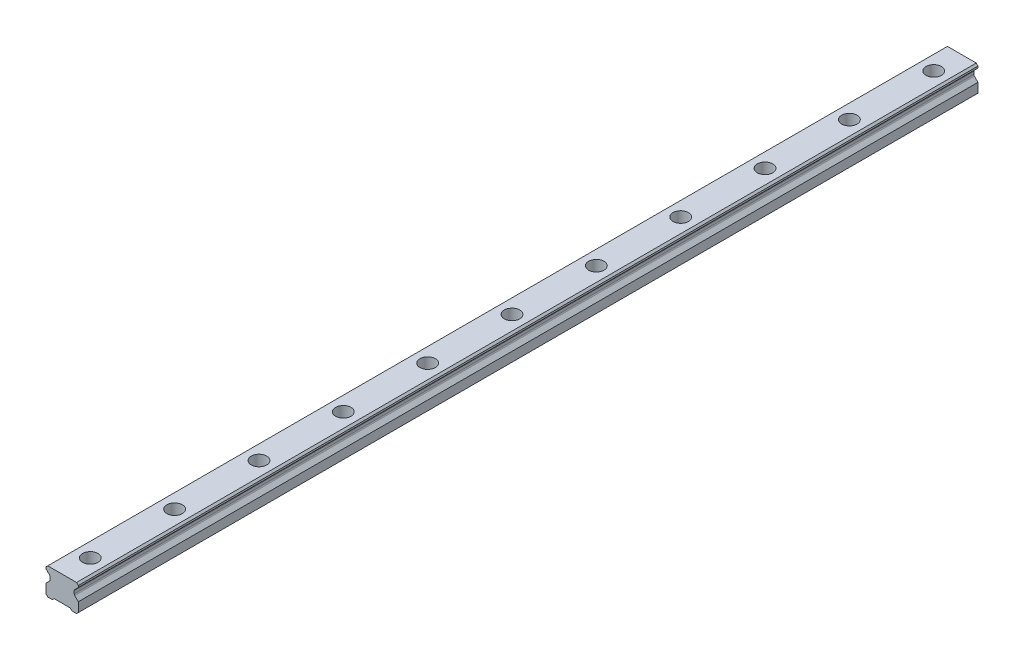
ISO-10303-21;
HEADER;
FILE_DESCRIPTION(('STEP AP214'),'2;1');
FILE_NAME('part.step','',(''),(''),'','','');
FILE_SCHEMA(('AUTOMOTIVE_DESIGN { 1 0 10303 214 1 1 1 1 }'));
ENDSEC;
DATA;
#1=APPLICATION_CONTEXT('core data for automotive mechanical design processes');
#2=APPLICATION_PROTOCOL_DEFINITION('international standard','automotive_design',2000,#1);
#3=PRODUCT_CONTEXT('',#1,'mechanical');
#4=PRODUCT('Part','Part','',(#3));
#5=PRODUCT_RELATED_PRODUCT_CATEGORY('part','',(#4));
#6=PRODUCT_DEFINITION_FORMATION('','',#4);
#7=PRODUCT_DEFINITION_CONTEXT('part definition',#1,'design');
#8=PRODUCT_DEFINITION('design','',#6,#7);
#9=PRODUCT_DEFINITION_SHAPE('','',#8);
#10=(LENGTH_UNIT() NAMED_UNIT(*) SI_UNIT(.MILLI.,.METRE.));
#11=(NAMED_UNIT(*) PLANE_ANGLE_UNIT() SI_UNIT($,.RADIAN.));
#12=(NAMED_UNIT(*) SI_UNIT($,.STERADIAN.) SOLID_ANGLE_UNIT());
#13=UNCERTAINTY_MEASURE_WITH_UNIT(LENGTH_MEASURE(1.E-05),#10,'distance_accuracy_value','');
#14=(GEOMETRIC_REPRESENTATION_CONTEXT(3) GLOBAL_UNCERTAINTY_ASSIGNED_CONTEXT((#13)) GLOBAL_UNIT_ASSIGNED_CONTEXT((#10,
#11,#12)) REPRESENTATION_CONTEXT('',''));
#15=CARTESIAN_POINT('',(0.,0.,0.));
#16=DIRECTION('',(0.,0.,1.));
#17=DIRECTION('',(1.,0.,0.));
#18=AXIS2_PLACEMENT_3D('',#15,#16,#17);
#19=CARTESIAN_POINT('',(0.,10.2,-300.));
#20=DIRECTION('',(0.,1.,0.));
#21=DIRECTION('',(0.,0.,1.));
#22=AXIS2_PLACEMENT_3D('',#19,#20,#21);
#23=PLANE('',#22);
#24=CARTESIAN_POINT('',(0.,10.2,-300.));
#25=DIRECTION('',(0.,1.,0.));
#26=DIRECTION('',(0.,0.,1.));
#27=AXIS2_PLACEMENT_3D('',#24,#25,#26);
#28=CIRCLE('',#27,3.5);
#29=CARTESIAN_POINT('',(0.,10.2,-296.5));
#30=VERTEX_POINT('',#29);
#31=EDGE_CURVE('E431',#30,#30,#28,.T.);
#32=ORIENTED_EDGE('',*,*,#31,.F.);
#33=EDGE_LOOP('',(#32));
#34=FACE_BOUND('',#33,.T.);
#35=CARTESIAN_POINT('',(0.,10.2,-300.));
#36=DIRECTION('',(0.,1.,0.));
#37=DIRECTION('',(0.,0.,1.));
#38=AXIS2_PLACEMENT_3D('',#35,#36,#37);
#39=CIRCLE('',#38,5.5);
#40=CARTESIAN_POINT('',(0.,10.2,-294.5));
#41=VERTEX_POINT('',#40);
#42=EDGE_CURVE('E11',#41,#41,#39,.T.);
#43=ORIENTED_EDGE('',*,*,#42,.T.);
#44=EDGE_LOOP('',(#43));
#45=FACE_BOUND('',#44,.T.);
#46=ADVANCED_FACE('F39',(#34,#45),#23,.T.);
#47=CARTESIAN_POINT('',(0.,10.2,-300.));
#48=DIRECTION('',(0.,1.,0.));
#49=DIRECTION('',(0.,0.,1.));
#50=AXIS2_PLACEMENT_3D('',#47,#48,#49);
#51=CYLINDRICAL_SURFACE('',#50,5.5);
#52=ORIENTED_EDGE('',*,*,#42,.F.);
#53=EDGE_LOOP('',(#52));
#54=FACE_BOUND('',#53,.T.);
#55=CARTESIAN_POINT('',(0.,19.2,-300.));
#56=DIRECTION('',(0.,1.,0.));
#57=DIRECTION('',(0.,0.,1.));
#58=AXIS2_PLACEMENT_3D('',#55,#56,#57);
#59=CIRCLE('',#58,5.5);
#60=CARTESIAN_POINT('',(0.,19.2,-294.5));
#61=VERTEX_POINT('',#60);
#62=EDGE_CURVE('E48',#61,#61,#59,.T.);
#63=ORIENTED_EDGE('',*,*,#62,.T.);
#64=EDGE_LOOP('',(#63));
#65=FACE_BOUND('',#64,.T.);
#66=ADVANCED_FACE('F696',(#54,#65),#51,.F.);
#67=CARTESIAN_POINT('',(0.,10.2,-240.));
#68=DIRECTION('',(0.,1.,0.));
#69=DIRECTION('',(0.,0.,1.));
#70=AXIS2_PLACEMENT_3D('',#67,#68,#69);
#71=PLANE('',#70);
#72=CARTESIAN_POINT('',(0.,10.2,-240.));
#73=DIRECTION('',(0.,1.,0.));
#74=DIRECTION('',(0.,0.,1.));
#75=AXIS2_PLACEMENT_3D('',#72,#73,#74);
#76=CIRCLE('',#75,3.5);
#77=CARTESIAN_POINT('',(0.,10.2,-236.5));
#78=VERTEX_POINT('',#77);
#79=EDGE_CURVE('E436',#78,#78,#76,.T.);
#80=ORIENTED_EDGE('',*,*,#79,.F.);
#81=EDGE_LOOP('',(#80));
#82=FACE_BOUND('',#81,.T.);
#83=CARTESIAN_POINT('',(0.,10.2,-240.));
#84=DIRECTION('',(0.,1.,0.));
#85=DIRECTION('',(0.,0.,1.));
#86=AXIS2_PLACEMENT_3D('',#83,#84,#85);
#87=CIRCLE('',#86,5.5);
#88=CARTESIAN_POINT('',(0.,10.2,-234.5));
#89=VERTEX_POINT('',#88);
#90=EDGE_CURVE('E415',#89,#89,#87,.T.);
#91=ORIENTED_EDGE('',*,*,#90,.T.);
#92=EDGE_LOOP('',(#91));
#93=FACE_BOUND('',#92,.T.);
#94=ADVANCED_FACE('F698',(#82,#93),#71,.T.);
#95=CARTESIAN_POINT('',(0.,10.2,-240.));
#96=DIRECTION('',(0.,1.,0.));
#97=DIRECTION('',(0.,0.,1.));
#98=AXIS2_PLACEMENT_3D('',#95,#96,#97);
#99=CYLINDRICAL_SURFACE('',#98,5.5);
#100=ORIENTED_EDGE('',*,*,#90,.F.);
#101=EDGE_LOOP('',(#100));
#102=FACE_BOUND('',#101,.T.);
#103=CARTESIAN_POINT('',(0.,19.2,-240.));
#104=DIRECTION('',(0.,1.,0.));
#105=DIRECTION('',(0.,0.,1.));
#106=AXIS2_PLACEMENT_3D('',#103,#104,#105);
#107=CIRCLE('',#106,5.5);
#108=CARTESIAN_POINT('',(0.,19.2,-234.5));
#109=VERTEX_POINT('',#108);
#110=EDGE_CURVE('E411',#109,#109,#107,.T.);
#111=ORIENTED_EDGE('',*,*,#110,.T.);
#112=EDGE_LOOP('',(#111));
#113=FACE_BOUND('',#112,.T.);
#114=ADVANCED_FACE('F704',(#102,#113),#99,.F.);
#115=CARTESIAN_POINT('',(0.,10.2,-180.));
#116=DIRECTION('',(0.,1.,0.));
#117=DIRECTION('',(0.,0.,1.));
#118=AXIS2_PLACEMENT_3D('',#115,#116,#117);
#119=PLANE('',#118);
#120=CARTESIAN_POINT('',(0.,10.2,-180.));
#121=DIRECTION('',(0.,1.,0.));
#122=DIRECTION('',(0.,0.,1.));
#123=AXIS2_PLACEMENT_3D('',#120,#121,#122);
#124=CIRCLE('',#123,3.5);
#125=CARTESIAN_POINT('',(0.,10.2,-176.5));
#126=VERTEX_POINT('',#125);
#127=EDGE_CURVE('E441',#126,#126,#124,.T.);
#128=ORIENTED_EDGE('',*,*,#127,.F.);
#129=EDGE_LOOP('',(#128));
#130=FACE_BOUND('',#129,.T.);
#131=CARTESIAN_POINT('',(0.,10.2,-180.));
#132=DIRECTION('',(0.,1.,0.));
#133=DIRECTION('',(0.,0.,1.));
#134=AXIS2_PLACEMENT_3D('',#131,#132,#133);
#135=CIRCLE('',#134,5.5);
#136=CARTESIAN_POINT('',(0.,10.2,-174.5));
#137=VERTEX_POINT('',#136);
#138=EDGE_CURVE('E407',#137,#137,#135,.T.);
#139=ORIENTED_EDGE('',*,*,#138,.T.);
#140=EDGE_LOOP('',(#139));
#141=FACE_BOUND('',#140,.T.);
#142=ADVANCED_FACE('F712',(#130,#141),#119,.T.);
#143=CARTESIAN_POINT('',(0.,10.2,-180.));
#144=DIRECTION('',(0.,1.,0.));
#145=DIRECTION('',(0.,0.,1.));
#146=AXIS2_PLACEMENT_3D('',#143,#144,#145);
#147=CYLINDRICAL_SURFACE('',#146,5.5);
#148=ORIENTED_EDGE('',*,*,#138,.F.);
#149=EDGE_LOOP('',(#148));
#150=FACE_BOUND('',#149,.T.);
#151=CARTESIAN_POINT('',(0.,19.2,-180.));
#152=DIRECTION('',(0.,1.,0.));
#153=DIRECTION('',(0.,0.,1.));
#154=AXIS2_PLACEMENT_3D('',#151,#152,#153);
#155=CIRCLE('',#154,5.5);
#156=CARTESIAN_POINT('',(0.,19.2,-174.5));
#157=VERTEX_POINT('',#156);
#158=EDGE_CURVE('E403',#157,#157,#155,.T.);
#159=ORIENTED_EDGE('',*,*,#158,.T.);
#160=EDGE_LOOP('',(#159));
#161=FACE_BOUND('',#160,.T.);
#162=ADVANCED_FACE('F716',(#150,#161),#147,.F.);
#163=CARTESIAN_POINT('',(0.,10.2,-120.));
#164=DIRECTION('',(0.,1.,0.));
#165=DIRECTION('',(0.,0.,1.));
#166=AXIS2_PLACEMENT_3D('',#163,#164,#165);
#167=PLANE('',#166);
#168=CARTESIAN_POINT('',(0.,10.2,-120.));
#169=DIRECTION('',(0.,1.,0.));
#170=DIRECTION('',(0.,0.,1.));
#171=AXIS2_PLACEMENT_3D('',#168,#169,#170);
#172=CIRCLE('',#171,3.5);
#173=CARTESIAN_POINT('',(0.,10.2,-116.5));
#174=VERTEX_POINT('',#173);
#175=EDGE_CURVE('E446',#174,#174,#172,.T.);
#176=ORIENTED_EDGE('',*,*,#175,.F.);
#177=EDGE_LOOP('',(#176));
#178=FACE_BOUND('',#177,.T.);
#179=CARTESIAN_POINT('',(0.,10.2,-120.));
#180=DIRECTION('',(0.,1.,0.));
#181=DIRECTION('',(0.,0.,1.));
#182=AXIS2_PLACEMENT_3D('',#179,#180,#181);
#183=CIRCLE('',#182,5.5);
#184=CARTESIAN_POINT('',(0.,10.2,-114.5));
#185=VERTEX_POINT('',#184);
#186=EDGE_CURVE('E399',#185,#185,#183,.T.);
#187=ORIENTED_EDGE('',*,*,#186,.T.);
#188=EDGE_LOOP('',(#187));
#189=FACE_BOUND('',#188,.T.);
#190=ADVANCED_FACE('F720',(#178,#189),#167,.T.);
#191=CARTESIAN_POINT('',(0.,10.2,-120.));
#192=DIRECTION('',(0.,1.,0.));
#193=DIRECTION('',(0.,0.,1.));
#194=AXIS2_PLACEMENT_3D('',#191,#192,#193);
#195=CYLINDRICAL_SURFACE('',#194,5.5);
#196=ORIENTED_EDGE('',*,*,#186,.F.);
#197=EDGE_LOOP('',(#196));
#198=FACE_BOUND('',#197,.T.);
#199=CARTESIAN_POINT('',(0.,19.2,-120.));
#200=DIRECTION('',(0.,1.,0.));
#201=DIRECTION('',(0.,0.,1.));
#202=AXIS2_PLACEMENT_3D('',#199,#200,#201);
#203=CIRCLE('',#202,5.5);
#204=CARTESIAN_POINT('',(0.,19.2,-114.5));
#205=VERTEX_POINT('',#204);
#206=EDGE_CURVE('E395',#205,#205,#203,.T.);
#207=ORIENTED_EDGE('',*,*,#206,.T.);
#208=EDGE_LOOP('',(#207));
#209=FACE_BOUND('',#208,.T.);
#210=ADVANCED_FACE('F672',(#198,#209),#195,.F.);
#211=CARTESIAN_POINT('',(0.,10.2,-60.));
#212=DIRECTION('',(0.,1.,0.));
#213=DIRECTION('',(0.,0.,1.));
#214=AXIS2_PLACEMENT_3D('',#211,#212,#213);
#215=PLANE('',#214);
#216=CARTESIAN_POINT('',(0.,10.2,-60.));
#217=DIRECTION('',(0.,1.,0.));
#218=DIRECTION('',(0.,0.,1.));
#219=AXIS2_PLACEMENT_3D('',#216,#217,#218);
#220=CIRCLE('',#219,3.5);
#221=CARTESIAN_POINT('',(0.,10.2,-56.5));
#222=VERTEX_POINT('',#221);
#223=EDGE_CURVE('E451',#222,#222,#220,.T.);
#224=ORIENTED_EDGE('',*,*,#223,.F.);
#225=EDGE_LOOP('',(#224));
#226=FACE_BOUND('',#225,.T.);
#227=CARTESIAN_POINT('',(0.,10.2,-60.));
#228=DIRECTION('',(0.,1.,0.));
#229=DIRECTION('',(0.,0.,1.));
#230=AXIS2_PLACEMENT_3D('',#227,#228,#229);
#231=CIRCLE('',#230,5.5);
#232=CARTESIAN_POINT('',(0.,10.2,-54.5));
#233=VERTEX_POINT('',#232);
#234=EDGE_CURVE('E391',#233,#233,#231,.T.);
#235=ORIENTED_EDGE('',*,*,#234,.T.);
#236=EDGE_LOOP('',(#235));
#237=FACE_BOUND('',#236,.T.);
#238=ADVANCED_FACE('F668',(#226,#237),#215,.T.);
#239=CARTESIAN_POINT('',(0.,10.2,-60.));
#240=DIRECTION('',(0.,1.,0.));
#241=DIRECTION('',(0.,0.,1.));
#242=AXIS2_PLACEMENT_3D('',#239,#240,#241);
#243=CYLINDRICAL_SURFACE('',#242,5.5);
#244=ORIENTED_EDGE('',*,*,#234,.F.);
#245=EDGE_LOOP('',(#244));
#246=FACE_BOUND('',#245,.T.);
#247=CARTESIAN_POINT('',(0.,19.2,-60.));
#248=DIRECTION('',(0.,1.,0.));
#249=DIRECTION('',(0.,0.,1.));
#250=AXIS2_PLACEMENT_3D('',#247,#248,#249);
#251=CIRCLE('',#250,5.5);
#252=CARTESIAN_POINT('',(0.,19.2,-54.5));
#253=VERTEX_POINT('',#252);
#254=EDGE_CURVE('E387',#253,#253,#251,.T.);
#255=ORIENTED_EDGE('',*,*,#254,.T.);
#256=EDGE_LOOP('',(#255));
#257=FACE_BOUND('',#256,.T.);
#258=ADVANCED_FACE('F671',(#246,#257),#243,.F.);
#259=CARTESIAN_POINT('',(0.,10.2,0.));
#260=DIRECTION('',(0.,1.,0.));
#261=DIRECTION('',(0.,0.,1.));
#262=AXIS2_PLACEMENT_3D('',#259,#260,#261);
#263=PLANE('',#262);
#264=CARTESIAN_POINT('',(0.,10.2,0.));
#265=DIRECTION('',(0.,1.,0.));
#266=DIRECTION('',(0.,0.,1.));
#267=AXIS2_PLACEMENT_3D('',#264,#265,#266);
#268=CIRCLE('',#267,3.5);
#269=CARTESIAN_POINT('',(0.,10.2,3.5));
#270=VERTEX_POINT('',#269);
#271=EDGE_CURVE('E456',#270,#270,#268,.T.);
#272=ORIENTED_EDGE('',*,*,#271,.F.);
#273=EDGE_LOOP('',(#272));
#274=FACE_BOUND('',#273,.T.);
#275=CARTESIAN_POINT('',(0.,10.2,0.));
#276=DIRECTION('',(0.,1.,0.));
#277=DIRECTION('',(0.,0.,1.));
#278=AXIS2_PLACEMENT_3D('',#275,#276,#277);
#279=CIRCLE('',#278,5.5);
#280=CARTESIAN_POINT('',(0.,10.2,5.5));
#281=VERTEX_POINT('',#280);
#282=EDGE_CURVE('E383',#281,#281,#279,.T.);
#283=ORIENTED_EDGE('',*,*,#282,.T.);
#284=EDGE_LOOP('',(#283));
#285=FACE_BOUND('',#284,.T.);
#286=ADVANCED_FACE('F678',(#274,#285),#263,.T.);
#287=CARTESIAN_POINT('',(0.,10.2,0.));
#288=DIRECTION('',(0.,1.,0.));
#289=DIRECTION('',(0.,0.,1.));
#290=AXIS2_PLACEMENT_3D('',#287,#288,#289);
#291=CYLINDRICAL_SURFACE('',#290,5.5);
#292=ORIENTED_EDGE('',*,*,#282,.F.);
#293=EDGE_LOOP('',(#292));
#294=FACE_BOUND('',#293,.T.);
#295=CARTESIAN_POINT('',(0.,19.2,0.));
#296=DIRECTION('',(0.,1.,0.));
#297=DIRECTION('',(0.,0.,1.));
#298=AXIS2_PLACEMENT_3D('',#295,#296,#297);
#299=CIRCLE('',#298,5.5);
#300=CARTESIAN_POINT('',(0.,19.2,5.5));
#301=VERTEX_POINT('',#300);
#302=EDGE_CURVE('E379',#301,#301,#299,.T.);
#303=ORIENTED_EDGE('',*,*,#302,.T.);
#304=EDGE_LOOP('',(#303));
#305=FACE_BOUND('',#304,.T.);
#306=ADVANCED_FACE('F730',(#294,#305),#291,.F.);
#307=CARTESIAN_POINT('',(0.,10.2,60.));
#308=DIRECTION('',(0.,1.,0.));
#309=DIRECTION('',(0.,0.,1.));
#310=AXIS2_PLACEMENT_3D('',#307,#308,#309);
#311=PLANE('',#310);
#312=CARTESIAN_POINT('',(0.,10.2,60.));
#313=DIRECTION('',(0.,1.,0.));
#314=DIRECTION('',(0.,0.,1.));
#315=AXIS2_PLACEMENT_3D('',#312,#313,#314);
#316=CIRCLE('',#315,3.5);
#317=CARTESIAN_POINT('',(0.,10.2,63.5));
#318=VERTEX_POINT('',#317);
#319=EDGE_CURVE('E460',#318,#318,#316,.T.);
#320=ORIENTED_EDGE('',*,*,#319,.F.);
#321=EDGE_LOOP('',(#320));
#322=FACE_BOUND('',#321,.T.);
#323=CARTESIAN_POINT('',(0.,10.2,60.));
#324=DIRECTION('',(0.,1.,0.));
#325=DIRECTION('',(0.,0.,1.));
#326=AXIS2_PLACEMENT_3D('',#323,#324,#325);
#327=CIRCLE('',#326,5.5);
#328=CARTESIAN_POINT('',(0.,10.2,65.5));
#329=VERTEX_POINT('',#328);
#330=EDGE_CURVE('E375',#329,#329,#327,.T.);
#331=ORIENTED_EDGE('',*,*,#330,.T.);
#332=EDGE_LOOP('',(#331));
#333=FACE_BOUND('',#332,.T.);
#334=ADVANCED_FACE('F734',(#322,#333),#311,.T.);
#335=CARTESIAN_POINT('',(0.,10.2,60.));
#336=DIRECTION('',(0.,1.,0.));
#337=DIRECTION('',(0.,0.,1.));
#338=AXIS2_PLACEMENT_3D('',#335,#336,#337);
#339=CYLINDRICAL_SURFACE('',#338,5.5);
#340=ORIENTED_EDGE('',*,*,#330,.F.);
#341=EDGE_LOOP('',(#340));
#342=FACE_BOUND('',#341,.T.);
#343=CARTESIAN_POINT('',(0.,19.2,60.));
#344=DIRECTION('',(0.,1.,0.));
#345=DIRECTION('',(0.,0.,1.));
#346=AXIS2_PLACEMENT_3D('',#343,#344,#345);
#347=CIRCLE('',#346,5.5);
#348=CARTESIAN_POINT('',(0.,19.2,65.5));
#349=VERTEX_POINT('',#348);
#350=EDGE_CURVE('E371',#349,#349,#347,.T.);
#351=ORIENTED_EDGE('',*,*,#350,.T.);
#352=EDGE_LOOP('',(#351));
#353=FACE_BOUND('',#352,.T.);
#354=ADVANCED_FACE('F738',(#342,#353),#339,.F.);
#355=CARTESIAN_POINT('',(0.,10.2,120.));
#356=DIRECTION('',(0.,1.,0.));
#357=DIRECTION('',(0.,0.,1.));
#358=AXIS2_PLACEMENT_3D('',#355,#356,#357);
#359=PLANE('',#358);
#360=CARTESIAN_POINT('',(0.,10.2,120.));
#361=DIRECTION('',(0.,1.,0.));
#362=DIRECTION('',(0.,0.,1.));
#363=AXIS2_PLACEMENT_3D('',#360,#361,#362);
#364=CIRCLE('',#363,3.5);
#365=CARTESIAN_POINT('',(0.,10.2,123.5));
#366=VERTEX_POINT('',#365);
#367=EDGE_CURVE('E464',#366,#366,#364,.T.);
#368=ORIENTED_EDGE('',*,*,#367,.F.);
#369=EDGE_LOOP('',(#368));
#370=FACE_BOUND('',#369,.T.);
#371=CARTESIAN_POINT('',(0.,10.2,120.));
#372=DIRECTION('',(0.,1.,0.));
#373=DIRECTION('',(0.,0.,1.));
#374=AXIS2_PLACEMENT_3D('',#371,#372,#373);
#375=CIRCLE('',#374,5.5);
#376=CARTESIAN_POINT('',(0.,10.2,125.5));
#377=VERTEX_POINT('',#376);
#378=EDGE_CURVE('E367',#377,#377,#375,.T.);
#379=ORIENTED_EDGE('',*,*,#378,.T.);
#380=EDGE_LOOP('',(#379));
#381=FACE_BOUND('',#380,.T.);
#382=ADVANCED_FACE('F742',(#370,#381),#359,.T.);
#383=CARTESIAN_POINT('',(0.,10.2,120.));
#384=DIRECTION('',(0.,1.,0.));
#385=DIRECTION('',(0.,0.,1.));
#386=AXIS2_PLACEMENT_3D('',#383,#384,#385);
#387=CYLINDRICAL_SURFACE('',#386,5.5);
#388=ORIENTED_EDGE('',*,*,#378,.F.);
#389=EDGE_LOOP('',(#388));
#390=FACE_BOUND('',#389,.T.);
#391=CARTESIAN_POINT('',(0.,19.2,120.));
#392=DIRECTION('',(0.,1.,0.));
#393=DIRECTION('',(0.,0.,1.));
#394=AXIS2_PLACEMENT_3D('',#391,#392,#393);
#395=CIRCLE('',#394,5.5);
#396=CARTESIAN_POINT('',(0.,19.2,125.5));
#397=VERTEX_POINT('',#396);
#398=EDGE_CURVE('E363',#397,#397,#395,.T.);
#399=ORIENTED_EDGE('',*,*,#398,.T.);
#400=EDGE_LOOP('',(#399));
#401=FACE_BOUND('',#400,.T.);
#402=ADVANCED_FACE('F746',(#390,#401),#387,.F.);
#403=CARTESIAN_POINT('',(0.,10.2,180.));
#404=DIRECTION('',(0.,1.,0.));
#405=DIRECTION('',(0.,0.,1.));
#406=AXIS2_PLACEMENT_3D('',#403,#404,#405);
#407=PLANE('',#406);
#408=CARTESIAN_POINT('',(0.,10.2,180.));
#409=DIRECTION('',(0.,1.,0.));
#410=DIRECTION('',(0.,0.,1.));
#411=AXIS2_PLACEMENT_3D('',#408,#409,#410);
#412=CIRCLE('',#411,3.5);
#413=CARTESIAN_POINT('',(0.,10.2,183.5));
#414=VERTEX_POINT('',#413);
#415=EDGE_CURVE('E480',#414,#414,#412,.T.);
#416=ORIENTED_EDGE('',*,*,#415,.F.);
#417=EDGE_LOOP('',(#416));
#418=FACE_BOUND('',#417,.T.);
#419=CARTESIAN_POINT('',(0.,10.2,180.));
#420=DIRECTION('',(0.,1.,0.));
#421=DIRECTION('',(0.,0.,1.));
#422=AXIS2_PLACEMENT_3D('',#419,#420,#421);
#423=CIRCLE('',#422,5.5);
#424=CARTESIAN_POINT('',(0.,10.2,185.5));
#425=VERTEX_POINT('',#424);
#426=EDGE_CURVE('E359',#425,#425,#423,.T.);
#427=ORIENTED_EDGE('',*,*,#426,.T.);
#428=EDGE_LOOP('',(#427));
#429=FACE_BOUND('',#428,.T.);
#430=ADVANCED_FACE('F750',(#418,#429),#407,.T.);
#431=CARTESIAN_POINT('',(0.,10.2,180.));
#432=DIRECTION('',(0.,1.,0.));
#433=DIRECTION('',(0.,0.,1.));
#434=AXIS2_PLACEMENT_3D('',#431,#432,#433);
#435=CYLINDRICAL_SURFACE('',#434,5.5);
#436=ORIENTED_EDGE('',*,*,#426,.F.);
#437=EDGE_LOOP('',(#436));
#438=FACE_BOUND('',#437,.T.);
#439=CARTESIAN_POINT('',(0.,19.2,180.));
#440=DIRECTION('',(0.,1.,0.));
#441=DIRECTION('',(0.,0.,1.));
#442=AXIS2_PLACEMENT_3D('',#439,#440,#441);
#443=CIRCLE('',#442,5.5);
#444=CARTESIAN_POINT('',(0.,19.2,185.5));
#445=VERTEX_POINT('',#444);
#446=EDGE_CURVE('E355',#445,#445,#443,.T.);
#447=ORIENTED_EDGE('',*,*,#446,.T.);
#448=EDGE_LOOP('',(#447));
#449=FACE_BOUND('',#448,.T.);
#450=ADVANCED_FACE('F754',(#438,#449),#435,.F.);
#451=CARTESIAN_POINT('',(11.5,0.,320.));
#452=DIRECTION('',(0.,1.,0.));
#453=DIRECTION('',(-1.,0.,0.));
#454=AXIS2_PLACEMENT_3D('',#451,#452,#453);
#455=PLANE('',#454);
#456=DIRECTION('',(1.,0.,0.));
#457=VECTOR('',#456,1.);
#458=CARTESIAN_POINT('',(11.5,0.,-320.));
#459=LINE('',#458,#457);
#460=CARTESIAN_POINT('',(-10.25,0.,-320.));
#461=VERTEX_POINT('',#460);
#462=CARTESIAN_POINT('',(-7.,0.,-320.));
#463=VERTEX_POINT('',#462);
#464=EDGE_CURVE('E229',#461,#463,#459,.T.);
#465=ORIENTED_EDGE('',*,*,#464,.T.);
#466=DIRECTION('',(0.,0.,1.));
#467=VECTOR('',#466,1.);
#468=CARTESIAN_POINT('',(-7.,0.,-320.));
#469=LINE('',#468,#467);
#470=CARTESIAN_POINT('',(-7.,0.,320.));
#471=VERTEX_POINT('',#470);
#472=EDGE_CURVE('E520',#463,#471,#469,.T.);
#473=ORIENTED_EDGE('',*,*,#472,.T.);
#474=DIRECTION('',(1.,0.,0.));
#475=VECTOR('',#474,1.);
#476=CARTESIAN_POINT('',(11.5,0.,320.));
#477=LINE('',#476,#475);
#478=CARTESIAN_POINT('',(-10.25,0.,320.));
#479=VERTEX_POINT('',#478);
#480=EDGE_CURVE('E589',#479,#471,#477,.T.);
#481=ORIENTED_EDGE('',*,*,#480,.F.);
#482=DIRECTION('',(0.,0.,-1.));
#483=VECTOR('',#482,1.);
#484=CARTESIAN_POINT('',(-10.25,0.,320.));
#485=LINE('',#484,#483);
#486=EDGE_CURVE('E290',#479,#461,#485,.T.);
#487=ORIENTED_EDGE('',*,*,#486,.T.);
#488=EDGE_LOOP('',(#465,#473,#481,#487));
#489=FACE_BOUND('',#488,.T.);
#490=ADVANCED_FACE('F758',(#489),#455,.F.);
#491=CARTESIAN_POINT('',(-11.5,19.2,320.));
#492=DIRECTION('',(1.,0.,0.));
#493=DIRECTION('',(0.,1.,0.));
#494=AXIS2_PLACEMENT_3D('',#491,#492,#493);
#495=PLANE('',#494);
#496=DIRECTION('',(0.,-1.,0.));
#497=VECTOR('',#496,1.);
#498=CARTESIAN_POINT('',(-11.5,19.2,320.));
#499=LINE('',#498,#497);
#500=CARTESIAN_POINT('',(-11.5,17.9499999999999,320.));
#501=VERTEX_POINT('',#500);
#502=CARTESIAN_POINT('',(-11.5,16.7,320.));
#503=VERTEX_POINT('',#502);
#504=EDGE_CURVE('E585',#501,#503,#499,.T.);
#505=ORIENTED_EDGE('',*,*,#504,.F.);
#506=DIRECTION('',(0.,0.,-1.));
#507=VECTOR('',#506,1.);
#508=CARTESIAN_POINT('',(-11.5,17.9499999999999,320.));
#509=LINE('',#508,#507);
#510=CARTESIAN_POINT('',(-11.5,17.9499999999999,-320.));
#511=VERTEX_POINT('',#510);
#512=EDGE_CURVE('E252',#501,#511,#509,.T.);
#513=ORIENTED_EDGE('',*,*,#512,.T.);
#514=DIRECTION('',(0.,-1.,0.));
#515=VECTOR('',#514,1.);
#516=CARTESIAN_POINT('',(-11.5,19.2,-320.));
#517=LINE('',#516,#515);
#518=CARTESIAN_POINT('',(-11.5,16.7,-320.));
#519=VERTEX_POINT('',#518);
#520=EDGE_CURVE('E230',#511,#519,#517,.T.);
#521=ORIENTED_EDGE('',*,*,#520,.T.);
#522=DIRECTION('',(0.,0.,1.));
#523=VECTOR('',#522,1.);
#524=CARTESIAN_POINT('',(-11.5,16.7,-320.));
#525=LINE('',#524,#523);
#526=EDGE_CURVE('E541',#519,#503,#525,.T.);
#527=ORIENTED_EDGE('',*,*,#526,.T.);
#528=EDGE_LOOP('',(#505,#513,#521,#527));
#529=FACE_BOUND('',#528,.T.);
#530=ADVANCED_FACE('F613',(#529),#495,.F.);
#531=CARTESIAN_POINT('',(11.5,19.2,320.));
#532=DIRECTION('',(-1.,0.,0.));
#533=DIRECTION('',(0.,0.,1.));
#534=AXIS2_PLACEMENT_3D('',#531,#532,#533);
#535=PLANE('',#534);
#536=DIRECTION('',(0.,1.,0.));
#537=VECTOR('',#536,1.);
#538=CARTESIAN_POINT('',(11.5,19.2,320.));
#539=LINE('',#538,#537);
#540=CARTESIAN_POINT('',(11.5,1.24999999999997,320.));
#541=VERTEX_POINT('',#540);
#542=CARTESIAN_POINT('',(11.5,7.95,320.));
#543=VERTEX_POINT('',#542);
#544=EDGE_CURVE('E594',#541,#543,#539,.T.);
#545=ORIENTED_EDGE('',*,*,#544,.F.);
#546=DIRECTION('',(0.,0.,-1.));
#547=VECTOR('',#546,1.);
#548=CARTESIAN_POINT('',(11.5,1.24999999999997,320.));
#549=LINE('',#548,#547);
#550=CARTESIAN_POINT('',(11.5,1.24999999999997,-320.));
#551=VERTEX_POINT('',#550);
#552=EDGE_CURVE('E297',#541,#551,#549,.T.);
#553=ORIENTED_EDGE('',*,*,#552,.T.);
#554=DIRECTION('',(0.,1.,0.));
#555=VECTOR('',#554,1.);
#556=CARTESIAN_POINT('',(11.5,19.2,-320.));
#557=LINE('',#556,#555);
#558=CARTESIAN_POINT('',(11.5,7.95,-320.));
#559=VERTEX_POINT('',#558);
#560=EDGE_CURVE('E243',#551,#559,#557,.T.);
#561=ORIENTED_EDGE('',*,*,#560,.T.);
#562=DIRECTION('',(0.,0.,1.));
#563=VECTOR('',#562,1.);
#564=CARTESIAN_POINT('',(11.5,7.95,-320.));
#565=LINE('',#564,#563);
#566=EDGE_CURVE('E570',#559,#543,#565,.T.);
#567=ORIENTED_EDGE('',*,*,#566,.T.);
#568=EDGE_LOOP('',(#545,#553,#561,#567));
#569=FACE_BOUND('',#568,.T.);
#570=ADVANCED_FACE('F789',(#569),#535,.F.);
#571=CARTESIAN_POINT('',(-11.5,7.95,-320.));
#572=VERTEX_POINT('',#571);
#573=CARTESIAN_POINT('',(-11.5,1.24999999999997,-320.));
#574=VERTEX_POINT('',#573);
#575=EDGE_CURVE('E239',#572,#574,#517,.T.);
#576=ORIENTED_EDGE('',*,*,#575,.T.);
#577=DIRECTION('',(0.,0.,1.));
#578=VECTOR('',#577,1.);
#579=CARTESIAN_POINT('',(-11.5,1.24999999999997,320.));
#580=LINE('',#579,#578);
#581=CARTESIAN_POINT('',(-11.5,1.24999999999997,320.));
#582=VERTEX_POINT('',#581);
#583=EDGE_CURVE('E294',#574,#582,#580,.T.);
#584=ORIENTED_EDGE('',*,*,#583,.T.);
#585=CARTESIAN_POINT('',(-11.5,7.95,320.));
#586=VERTEX_POINT('',#585);
#587=EDGE_CURVE('E251',#586,#582,#499,.T.);
#588=ORIENTED_EDGE('',*,*,#587,.F.);
#589=DIRECTION('',(0.,0.,1.));
#590=VECTOR('',#589,1.);
#591=CARTESIAN_POINT('',(-11.5,7.95,-320.));
#592=LINE('',#591,#590);
#593=EDGE_CURVE('E552',#572,#586,#592,.T.);
#594=ORIENTED_EDGE('',*,*,#593,.F.);
#595=EDGE_LOOP('',(#576,#584,#588,#594));
#596=FACE_BOUND('',#595,.T.);
#597=ADVANCED_FACE('F641',(#596),#495,.F.);
#598=CARTESIAN_POINT('',(7.,0.,320.));
#599=VERTEX_POINT('',#598);
#600=CARTESIAN_POINT('',(10.2500000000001,0.,320.));
#601=VERTEX_POINT('',#600);
#602=EDGE_CURVE('E219',#599,#601,#477,.T.);
#603=ORIENTED_EDGE('',*,*,#602,.F.);
#604=DIRECTION('',(0.,0.,1.));
#605=VECTOR('',#604,1.);
#606=CARTESIAN_POINT('',(7.,0.,-320.));
#607=LINE('',#606,#605);
#608=CARTESIAN_POINT('',(7.,0.,-320.));
#609=VERTEX_POINT('',#608);
#610=EDGE_CURVE('E206',#609,#599,#607,.T.);
#611=ORIENTED_EDGE('',*,*,#610,.F.);
#612=CARTESIAN_POINT('',(10.2500000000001,0.,-320.));
#613=VERTEX_POINT('',#612);
#614=EDGE_CURVE('E217',#609,#613,#459,.T.);
#615=ORIENTED_EDGE('',*,*,#614,.T.);
#616=DIRECTION('',(0.,0.,1.));
#617=VECTOR('',#616,1.);
#618=CARTESIAN_POINT('',(10.2500000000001,0.,320.));
#619=LINE('',#618,#617);
#620=EDGE_CURVE('E287',#613,#601,#619,.T.);
#621=ORIENTED_EDGE('',*,*,#620,.T.);
#622=EDGE_LOOP('',(#603,#611,#615,#621));
#623=FACE_BOUND('',#622,.T.);
#624=ADVANCED_FACE('F215',(#623),#455,.F.);
#625=CARTESIAN_POINT('',(11.5,16.7,-320.));
#626=VERTEX_POINT('',#625);
#627=CARTESIAN_POINT('',(11.5,17.95,-320.));
#628=VERTEX_POINT('',#627);
#629=EDGE_CURVE('E236',#626,#628,#557,.T.);
#630=ORIENTED_EDGE('',*,*,#629,.T.);
#631=DIRECTION('',(0.,0.,1.));
#632=VECTOR('',#631,1.);
#633=CARTESIAN_POINT('',(11.5,17.95,320.));
#634=LINE('',#633,#632);
#635=CARTESIAN_POINT('',(11.5,17.95,320.));
#636=VERTEX_POINT('',#635);
#637=EDGE_CURVE('E301',#628,#636,#634,.T.);
#638=ORIENTED_EDGE('',*,*,#637,.T.);
#639=CARTESIAN_POINT('',(11.5,16.7,320.));
#640=VERTEX_POINT('',#639);
#641=EDGE_CURVE('E593',#640,#636,#539,.T.);
#642=ORIENTED_EDGE('',*,*,#641,.F.);
#643=DIRECTION('',(0.,0.,1.));
#644=VECTOR('',#643,1.);
#645=CARTESIAN_POINT('',(11.5,16.7,-320.));
#646=LINE('',#645,#644);
#647=EDGE_CURVE('E546',#626,#640,#646,.T.);
#648=ORIENTED_EDGE('',*,*,#647,.F.);
#649=EDGE_LOOP('',(#630,#638,#642,#648));
#650=FACE_BOUND('',#649,.T.);
#651=ADVANCED_FACE('F685',(#650),#535,.F.);
#652=CARTESIAN_POINT('',(11.5,19.2,320.));
#653=DIRECTION('',(0.,-1.,0.));
#654=DIRECTION('',(0.,0.,-1.));
#655=AXIS2_PLACEMENT_3D('',#652,#653,#654);
#656=PLANE('',#655);
#657=CARTESIAN_POINT('',(0.,19.2,240.));
#658=DIRECTION('',(0.,1.,0.));
#659=DIRECTION('',(0.,0.,1.));
#660=AXIS2_PLACEMENT_3D('',#657,#658,#659);
#661=CIRCLE('',#660,5.5);
#662=CARTESIAN_POINT('',(0.,19.2,245.5));
#663=VERTEX_POINT('',#662);
#664=EDGE_CURVE('E483',#663,#663,#661,.T.);
#665=ORIENTED_EDGE('',*,*,#664,.F.);
#666=EDGE_LOOP('',(#665));
#667=FACE_BOUND('',#666,.T.);
#668=CARTESIAN_POINT('',(0.,19.2,300.));
#669=DIRECTION('',(0.,1.,0.));
#670=DIRECTION('',(0.,0.,1.));
#671=AXIS2_PLACEMENT_3D('',#668,#669,#670);
#672=CIRCLE('',#671,5.5);
#673=CARTESIAN_POINT('',(0.,19.2,305.5));
#674=VERTEX_POINT('',#673);
#675=EDGE_CURVE('E499',#674,#674,#672,.T.);
#676=ORIENTED_EDGE('',*,*,#675,.F.);
#677=EDGE_LOOP('',(#676));
#678=FACE_BOUND('',#677,.T.);
#679=DIRECTION('',(-1.,0.,0.));
#680=VECTOR('',#679,1.);
#681=CARTESIAN_POINT('',(11.5,19.2,-320.));
#682=LINE('',#681,#680);
#683=CARTESIAN_POINT('',(10.25,19.2,-320.));
#684=VERTEX_POINT('',#683);
#685=CARTESIAN_POINT('',(-10.2499999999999,19.2,-320.));
#686=VERTEX_POINT('',#685);
#687=EDGE_CURVE('E247',#684,#686,#682,.T.);
#688=ORIENTED_EDGE('',*,*,#687,.T.);
#689=DIRECTION('',(0.,0.,1.));
#690=VECTOR('',#689,1.);
#691=CARTESIAN_POINT('',(-10.2499999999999,19.2,320.));
#692=LINE('',#691,#690);
#693=CARTESIAN_POINT('',(-10.2499999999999,19.2,320.));
#694=VERTEX_POINT('',#693);
#695=EDGE_CURVE('E272',#686,#694,#692,.T.);
#696=ORIENTED_EDGE('',*,*,#695,.T.);
#697=DIRECTION('',(-1.,0.,0.));
#698=VECTOR('',#697,1.);
#699=CARTESIAN_POINT('',(11.5,19.2,320.));
#700=LINE('',#699,#698);
#701=CARTESIAN_POINT('',(10.25,19.2,320.));
#702=VERTEX_POINT('',#701);
#703=EDGE_CURVE('E257',#702,#694,#700,.T.);
#704=ORIENTED_EDGE('',*,*,#703,.F.);
#705=DIRECTION('',(0.,0.,-1.));
#706=VECTOR('',#705,1.);
#707=CARTESIAN_POINT('',(10.25,19.2,320.));
#708=LINE('',#707,#706);
#709=EDGE_CURVE('E268',#702,#684,#708,.T.);
#710=ORIENTED_EDGE('',*,*,#709,.T.);
#711=EDGE_LOOP('',(#688,#696,#704,#710));
#712=FACE_BOUND('',#711,.T.);
#713=ORIENTED_EDGE('',*,*,#446,.F.);
#714=EDGE_LOOP('',(#713));
#715=FACE_BOUND('',#714,.T.);
#716=ORIENTED_EDGE('',*,*,#398,.F.);
#717=EDGE_LOOP('',(#716));
#718=FACE_BOUND('',#717,.T.);
#719=ORIENTED_EDGE('',*,*,#350,.F.);
#720=EDGE_LOOP('',(#719));
#721=FACE_BOUND('',#720,.T.);
#722=ORIENTED_EDGE('',*,*,#302,.F.);
#723=EDGE_LOOP('',(#722));
#724=FACE_BOUND('',#723,.T.);
#725=ORIENTED_EDGE('',*,*,#254,.F.);
#726=EDGE_LOOP('',(#725));
#727=FACE_BOUND('',#726,.T.);
#728=ORIENTED_EDGE('',*,*,#206,.F.);
#729=EDGE_LOOP('',(#728));
#730=FACE_BOUND('',#729,.T.);
#731=ORIENTED_EDGE('',*,*,#158,.F.);
#732=EDGE_LOOP('',(#731));
#733=FACE_BOUND('',#732,.T.);
#734=ORIENTED_EDGE('',*,*,#110,.F.);
#735=EDGE_LOOP('',(#734));
#736=FACE_BOUND('',#735,.T.);
#737=ORIENTED_EDGE('',*,*,#62,.F.);
#738=EDGE_LOOP('',(#737));
#739=FACE_BOUND('',#738,.T.);
#740=ADVANCED_FACE('F682',(#667,#678,#712,#715,#718,#721,#724,#727,#730,#733,#736,#739),#656,.F.);
#741=CARTESIAN_POINT('',(0.,0.,320.));
#742=DIRECTION('',(0.,0.,-1.));
#743=DIRECTION('',(-1.,0.,0.));
#744=AXIS2_PLACEMENT_3D('',#741,#742,#743);
#745=PLANE('',#744);
#746=ORIENTED_EDGE('',*,*,#480,.T.);
#747=DIRECTION('',(-0.707106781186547,-0.707106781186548,0.));
#748=VECTOR('',#747,1.);
#749=CARTESIAN_POINT('',(-7.,0.,320.));
#750=LINE('',#749,#748);
#751=CARTESIAN_POINT('',(-5.75,1.25,320.));
#752=VERTEX_POINT('',#751);
#753=EDGE_CURVE('E211',#752,#471,#750,.T.);
#754=ORIENTED_EDGE('',*,*,#753,.F.);
#755=DIRECTION('',(-1.,0.,0.));
#756=VECTOR('',#755,1.);
#757=CARTESIAN_POINT('',(-5.75,1.25,320.));
#758=LINE('',#757,#756);
#759=CARTESIAN_POINT('',(5.75,1.25,320.));
#760=VERTEX_POINT('',#759);
#761=EDGE_CURVE('E514',#760,#752,#758,.T.);
#762=ORIENTED_EDGE('',*,*,#761,.F.);
#763=DIRECTION('',(-0.707106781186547,0.707106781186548,0.));
#764=VECTOR('',#763,1.);
#765=CARTESIAN_POINT('',(5.75,1.25,320.));
#766=LINE('',#765,#764);
#767=EDGE_CURVE('E504',#599,#760,#766,.T.);
#768=ORIENTED_EDGE('',*,*,#767,.F.);
#769=ORIENTED_EDGE('',*,*,#602,.T.);
#770=DIRECTION('',(-0.707106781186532,-0.707106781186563,0.));
#771=VECTOR('',#770,1.);
#772=CARTESIAN_POINT('',(11.5,1.24999999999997,320.));
#773=LINE('',#772,#771);
#774=EDGE_CURVE('E278',#601,#541,#773,.F.);
#775=ORIENTED_EDGE('',*,*,#774,.T.);
#776=ORIENTED_EDGE('',*,*,#544,.T.);
#777=DIRECTION('',(0.707106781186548,-0.707106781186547,0.));
#778=VECTOR('',#777,1.);
#779=CARTESIAN_POINT('',(11.5,7.95,320.));
#780=LINE('',#779,#778);
#781=CARTESIAN_POINT('',(8.94944985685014,10.5005501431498,320.));
#782=VERTEX_POINT('',#781);
#783=EDGE_CURVE('E524',#782,#543,#780,.T.);
#784=ORIENTED_EDGE('',*,*,#783,.F.);
#785=CARTESIAN_POINT('',(9.83333333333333,11.384433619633,320.));
#786=DIRECTION('',(0.,0.,-1.));
#787=DIRECTION('',(-1.,0.,0.));
#788=AXIS2_PLACEMENT_3D('',#785,#786,#787);
#789=CIRCLE('',#788,1.25);
#790=CARTESIAN_POINT('',(8.58333333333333,11.384433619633,320.));
#791=VERTEX_POINT('',#790);
#792=EDGE_CURVE('E332',#782,#791,#789,.T.);
#793=ORIENTED_EDGE('',*,*,#792,.T.);
#794=DIRECTION('',(0.,-1.,0.));
#795=VECTOR('',#794,1.);
#796=CARTESIAN_POINT('',(8.58333333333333,10.8666666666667,320.));
#797=LINE('',#796,#795);
#798=CARTESIAN_POINT('',(8.58333333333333,13.265566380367,320.));
#799=VERTEX_POINT('',#798);
#800=EDGE_CURVE('E562',#799,#791,#797,.T.);
#801=ORIENTED_EDGE('',*,*,#800,.F.);
#802=CARTESIAN_POINT('',(9.83333333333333,13.265566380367,320.));
#803=DIRECTION('',(0.,0.,-1.));
#804=DIRECTION('',(-1.,0.,0.));
#805=AXIS2_PLACEMENT_3D('',#802,#803,#804);
#806=CIRCLE('',#805,1.25);
#807=CARTESIAN_POINT('',(8.94944985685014,14.1494498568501,320.));
#808=VERTEX_POINT('',#807);
#809=EDGE_CURVE('E338',#799,#808,#806,.T.);
#810=ORIENTED_EDGE('',*,*,#809,.T.);
#811=DIRECTION('',(-0.707106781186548,-0.707106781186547,0.));
#812=VECTOR('',#811,1.);
#813=CARTESIAN_POINT('',(8.58333333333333,13.7833333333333,320.));
#814=LINE('',#813,#812);
#815=EDGE_CURVE('E573',#640,#808,#814,.T.);
#816=ORIENTED_EDGE('',*,*,#815,.F.);
#817=ORIENTED_EDGE('',*,*,#641,.T.);
#818=DIRECTION('',(0.707106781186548,-0.707106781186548,0.));
#819=VECTOR('',#818,1.);
#820=CARTESIAN_POINT('',(10.25,19.2,320.));
#821=LINE('',#820,#819);
#822=EDGE_CURVE('E275',#636,#702,#821,.F.);
#823=ORIENTED_EDGE('',*,*,#822,.T.);
#824=ORIENTED_EDGE('',*,*,#703,.T.);
#825=DIRECTION('',(0.707106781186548,0.707106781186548,0.));
#826=VECTOR('',#825,1.);
#827=CARTESIAN_POINT('',(-11.5,17.9499999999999,320.));
#828=LINE('',#827,#826);
#829=EDGE_CURVE('E284',#694,#501,#828,.F.);
#830=ORIENTED_EDGE('',*,*,#829,.T.);
#831=ORIENTED_EDGE('',*,*,#504,.T.);
#832=DIRECTION('',(-0.707106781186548,0.707106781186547,0.));
#833=VECTOR('',#832,1.);
#834=CARTESIAN_POINT('',(-8.58333333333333,13.7833333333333,320.));
#835=LINE('',#834,#833);
#836=CARTESIAN_POINT('',(-8.94944985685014,14.1494498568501,320.));
#837=VERTEX_POINT('',#836);
#838=EDGE_CURVE('E542',#837,#503,#835,.T.);
#839=ORIENTED_EDGE('',*,*,#838,.F.);
#840=CARTESIAN_POINT('',(-9.83333333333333,13.265566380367,320.));
#841=DIRECTION('',(0.,0.,-1.));
#842=DIRECTION('',(-1.,0.,0.));
#843=AXIS2_PLACEMENT_3D('',#840,#841,#842);
#844=CIRCLE('',#843,1.25);
#845=CARTESIAN_POINT('',(-8.58333333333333,13.265566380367,320.));
#846=VERTEX_POINT('',#845);
#847=EDGE_CURVE('E350',#837,#846,#844,.T.);
#848=ORIENTED_EDGE('',*,*,#847,.T.);
#849=DIRECTION('',(0.,1.,0.));
#850=VECTOR('',#849,1.);
#851=CARTESIAN_POINT('',(-8.58333333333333,10.8666666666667,320.));
#852=LINE('',#851,#850);
#853=CARTESIAN_POINT('',(-8.58333333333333,11.384433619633,320.));
#854=VERTEX_POINT('',#853);
#855=EDGE_CURVE('E534',#854,#846,#852,.T.);
#856=ORIENTED_EDGE('',*,*,#855,.F.);
#857=CARTESIAN_POINT('',(-9.83333333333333,11.384433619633,320.));
#858=DIRECTION('',(0.,0.,-1.));
#859=DIRECTION('',(-1.,0.,0.));
#860=AXIS2_PLACEMENT_3D('',#857,#858,#859);
#861=CIRCLE('',#860,1.25);
#862=CARTESIAN_POINT('',(-8.94944985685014,10.5005501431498,320.));
#863=VERTEX_POINT('',#862);
#864=EDGE_CURVE('E344',#854,#863,#861,.T.);
#865=ORIENTED_EDGE('',*,*,#864,.T.);
#866=DIRECTION('',(0.707106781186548,0.707106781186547,0.));
#867=VECTOR('',#866,1.);
#868=CARTESIAN_POINT('',(-11.5,7.95,320.));
#869=LINE('',#868,#867);
#870=EDGE_CURVE('E545',#586,#863,#869,.T.);
#871=ORIENTED_EDGE('',*,*,#870,.F.);
#872=ORIENTED_EDGE('',*,*,#587,.T.);
#873=DIRECTION('',(-0.707106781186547,0.707106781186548,0.));
#874=VECTOR('',#873,1.);
#875=CARTESIAN_POINT('',(-10.25,0.,320.));
#876=LINE('',#875,#874);
#877=EDGE_CURVE('E281',#582,#479,#876,.F.);
#878=ORIENTED_EDGE('',*,*,#877,.T.);
#879=EDGE_LOOP('',(#746,#754,#762,#768,#769,#775,#776,#784,#793,#801,#810,#816,#817,#823,#824,
#830,#831,#839,#848,#856,#865,#871,#872,#878));
#880=FACE_BOUND('',#879,.T.);
#881=ADVANCED_FACE('F601',(#880),#745,.F.);
#882=CARTESIAN_POINT('',(0.,0.,-320.));
#883=DIRECTION('',(0.,0.,-1.));
#884=DIRECTION('',(-1.,0.,0.));
#885=AXIS2_PLACEMENT_3D('',#882,#883,#884);
#886=PLANE('',#885);
#887=DIRECTION('',(-0.707106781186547,-0.707106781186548,0.));
#888=VECTOR('',#887,1.);
#889=CARTESIAN_POINT('',(-7.,0.,-320.));
#890=LINE('',#889,#888);
#891=CARTESIAN_POINT('',(-5.75,1.25,-320.));
#892=VERTEX_POINT('',#891);
#893=EDGE_CURVE('E221',#892,#463,#890,.T.);
#894=ORIENTED_EDGE('',*,*,#893,.T.);
#895=ORIENTED_EDGE('',*,*,#464,.F.);
#896=DIRECTION('',(0.707106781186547,-0.707106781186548,0.));
#897=VECTOR('',#896,1.);
#898=CARTESIAN_POINT('',(-5.12500000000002,-5.12500000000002,-320.));
#899=LINE('',#898,#897);
#900=EDGE_CURVE('E262',#461,#574,#899,.F.);
#901=ORIENTED_EDGE('',*,*,#900,.T.);
#902=ORIENTED_EDGE('',*,*,#575,.F.);
#903=DIRECTION('',(0.707106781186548,0.707106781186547,0.));
#904=VECTOR('',#903,1.);
#905=CARTESIAN_POINT('',(-11.5,7.95,-320.));
#906=LINE('',#905,#904);
#907=CARTESIAN_POINT('',(-8.94944985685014,10.5005501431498,-320.));
#908=VERTEX_POINT('',#907);
#909=EDGE_CURVE('E533',#572,#908,#906,.T.);
#910=ORIENTED_EDGE('',*,*,#909,.T.);
#911=CARTESIAN_POINT('',(-9.83333333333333,11.384433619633,-320.));
#912=DIRECTION('',(0.,0.,-1.));
#913=DIRECTION('',(-1.,0.,0.));
#914=AXIS2_PLACEMENT_3D('',#911,#912,#913);
#915=CIRCLE('',#914,1.25);
#916=CARTESIAN_POINT('',(-8.58333333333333,11.384433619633,-320.));
#917=VERTEX_POINT('',#916);
#918=EDGE_CURVE('E347',#908,#917,#915,.F.);
#919=ORIENTED_EDGE('',*,*,#918,.T.);
#920=DIRECTION('',(0.,1.,0.));
#921=VECTOR('',#920,1.);
#922=CARTESIAN_POINT('',(-8.58333333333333,10.8666666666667,-320.));
#923=LINE('',#922,#921);
#924=CARTESIAN_POINT('',(-8.58333333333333,13.265566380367,-320.));
#925=VERTEX_POINT('',#924);
#926=EDGE_CURVE('E538',#917,#925,#923,.T.);
#927=ORIENTED_EDGE('',*,*,#926,.T.);
#928=CARTESIAN_POINT('',(-9.83333333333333,13.265566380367,-320.));
#929=DIRECTION('',(0.,0.,-1.));
#930=DIRECTION('',(-1.,0.,0.));
#931=AXIS2_PLACEMENT_3D('',#928,#929,#930);
#932=CIRCLE('',#931,1.25);
#933=CARTESIAN_POINT('',(-8.94944985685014,14.1494498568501,-320.));
#934=VERTEX_POINT('',#933);
#935=EDGE_CURVE('E64',#925,#934,#932,.F.);
#936=ORIENTED_EDGE('',*,*,#935,.T.);
#937=DIRECTION('',(-0.707106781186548,0.707106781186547,0.));
#938=VECTOR('',#937,1.);
#939=CARTESIAN_POINT('',(-8.58333333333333,13.7833333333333,-320.));
#940=LINE('',#939,#938);
#941=EDGE_CURVE('E530',#934,#519,#940,.T.);
#942=ORIENTED_EDGE('',*,*,#941,.T.);
#943=ORIENTED_EDGE('',*,*,#520,.F.);
#944=DIRECTION('',(-0.707106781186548,-0.707106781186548,0.));
#945=VECTOR('',#944,1.);
#946=CARTESIAN_POINT('',(-14.725,14.725,-320.));
#947=LINE('',#946,#945);
#948=EDGE_CURVE('E265',#511,#686,#947,.F.);
#949=ORIENTED_EDGE('',*,*,#948,.T.);
#950=ORIENTED_EDGE('',*,*,#687,.F.);
#951=DIRECTION('',(-0.707106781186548,0.707106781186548,0.));
#952=VECTOR('',#951,1.);
#953=CARTESIAN_POINT('',(14.725,14.725,-320.));
#954=LINE('',#953,#952);
#955=EDGE_CURVE('E256',#684,#628,#954,.F.);
#956=ORIENTED_EDGE('',*,*,#955,.T.);
#957=ORIENTED_EDGE('',*,*,#629,.F.);
#958=DIRECTION('',(-0.707106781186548,-0.707106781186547,0.));
#959=VECTOR('',#958,1.);
#960=CARTESIAN_POINT('',(8.58333333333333,13.7833333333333,-320.));
#961=LINE('',#960,#959);
#962=CARTESIAN_POINT('',(8.94944985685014,14.1494498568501,-320.));
#963=VERTEX_POINT('',#962);
#964=EDGE_CURVE('E561',#626,#963,#961,.T.);
#965=ORIENTED_EDGE('',*,*,#964,.T.);
#966=CARTESIAN_POINT('',(9.83333333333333,13.265566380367,-320.));
#967=DIRECTION('',(0.,0.,-1.));
#968=DIRECTION('',(-1.,0.,0.));
#969=AXIS2_PLACEMENT_3D('',#966,#967,#968);
#970=CIRCLE('',#969,1.25);
#971=CARTESIAN_POINT('',(8.58333333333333,13.265566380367,-320.));
#972=VERTEX_POINT('',#971);
#973=EDGE_CURVE('E341',#963,#972,#970,.F.);
#974=ORIENTED_EDGE('',*,*,#973,.T.);
#975=DIRECTION('',(0.,-1.,0.));
#976=VECTOR('',#975,1.);
#977=CARTESIAN_POINT('',(8.58333333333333,10.8666666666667,-320.));
#978=LINE('',#977,#976);
#979=CARTESIAN_POINT('',(8.58333333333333,11.384433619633,-320.));
#980=VERTEX_POINT('',#979);
#981=EDGE_CURVE('E566',#972,#980,#978,.T.);
#982=ORIENTED_EDGE('',*,*,#981,.T.);
#983=CARTESIAN_POINT('',(9.83333333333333,11.384433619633,-320.));
#984=DIRECTION('',(0.,0.,-1.));
#985=DIRECTION('',(-1.,0.,0.));
#986=AXIS2_PLACEMENT_3D('',#983,#984,#985);
#987=CIRCLE('',#986,1.25);
#988=CARTESIAN_POINT('',(8.94944985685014,10.5005501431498,-320.));
#989=VERTEX_POINT('',#988);
#990=EDGE_CURVE('E335',#980,#989,#987,.F.);
#991=ORIENTED_EDGE('',*,*,#990,.T.);
#992=DIRECTION('',(0.707106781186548,-0.707106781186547,0.));
#993=VECTOR('',#992,1.);
#994=CARTESIAN_POINT('',(11.5,7.95,-320.));
#995=LINE('',#994,#993);
#996=EDGE_CURVE('E558',#989,#559,#995,.T.);
#997=ORIENTED_EDGE('',*,*,#996,.T.);
#998=ORIENTED_EDGE('',*,*,#560,.F.);
#999=DIRECTION('',(0.707106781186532,0.707106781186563,0.));
#1000=VECTOR('',#999,1.);
#1001=CARTESIAN_POINT('',(5.12500000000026,-5.12500000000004,-320.));
#1002=LINE('',#1001,#1000);
#1003=EDGE_CURVE('E226',#551,#613,#1002,.F.);
#1004=ORIENTED_EDGE('',*,*,#1003,.T.);
#1005=ORIENTED_EDGE('',*,*,#614,.F.);
#1006=DIRECTION('',(-0.707106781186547,0.707106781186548,0.));
#1007=VECTOR('',#1006,1.);
#1008=CARTESIAN_POINT('',(5.75,1.25,-320.));
#1009=LINE('',#1008,#1007);
#1010=CARTESIAN_POINT('',(5.75,1.25,-320.));
#1011=VERTEX_POINT('',#1010);
#1012=EDGE_CURVE('E202',#609,#1011,#1009,.T.);
#1013=ORIENTED_EDGE('',*,*,#1012,.T.);
#1014=DIRECTION('',(-1.,0.,0.));
#1015=VECTOR('',#1014,1.);
#1016=CARTESIAN_POINT('',(-5.75,1.25,-320.));
#1017=LINE('',#1016,#1015);
#1018=EDGE_CURVE('E56',#1011,#892,#1017,.T.);
#1019=ORIENTED_EDGE('',*,*,#1018,.T.);
#1020=EDGE_LOOP('',(#894,#895,#901,#902,#910,#919,#927,#936,#942,#943,#949,#950,#956,#957,#965,
#974,#982,#991,#997,#998,#1004,#1005,#1013,#1019));
#1021=FACE_BOUND('',#1020,.T.);
#1022=ADVANCED_FACE('F224',(#1021),#886,.T.);
#1023=CARTESIAN_POINT('',(11.5,7.95,-320.));
#1024=DIRECTION('',(-0.707106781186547,-0.707106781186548,0.));
#1025=DIRECTION('',(0.707106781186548,-0.707106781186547,0.));
#1026=AXIS2_PLACEMENT_3D('',#1023,#1024,#1025);
#1027=PLANE('',#1026);
#1028=ORIENTED_EDGE('',*,*,#996,.F.);
#1029=DIRECTION('',(0.,0.,1.));
#1030=VECTOR('',#1029,1.);
#1031=CARTESIAN_POINT('',(8.94944985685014,10.5005501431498,320.));
#1032=LINE('',#1031,#1030);
#1033=EDGE_CURVE('E304',#989,#782,#1032,.T.);
#1034=ORIENTED_EDGE('',*,*,#1033,.T.);
#1035=ORIENTED_EDGE('',*,*,#783,.T.);
#1036=ORIENTED_EDGE('',*,*,#566,.F.);
#1037=EDGE_LOOP('',(#1028,#1034,#1035,#1036));
#1038=FACE_BOUND('',#1037,.T.);
#1039=ADVANCED_FACE('F797',(#1038),#1027,.F.);
#1040=CARTESIAN_POINT('',(8.58333333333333,10.8666666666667,-320.));
#1041=DIRECTION('',(-1.,0.,0.));
#1042=DIRECTION('',(0.,0.,1.));
#1043=AXIS2_PLACEMENT_3D('',#1040,#1041,#1042);
#1044=PLANE('',#1043);
#1045=ORIENTED_EDGE('',*,*,#800,.T.);
#1046=DIRECTION('',(0.,0.,1.));
#1047=VECTOR('',#1046,1.);
#1048=CARTESIAN_POINT('',(8.58333333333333,11.384433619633,-320.));
#1049=LINE('',#1048,#1047);
#1050=EDGE_CURVE('E312',#791,#980,#1049,.F.);
#1051=ORIENTED_EDGE('',*,*,#1050,.T.);
#1052=ORIENTED_EDGE('',*,*,#981,.F.);
#1053=DIRECTION('',(0.,0.,1.));
#1054=VECTOR('',#1053,1.);
#1055=CARTESIAN_POINT('',(8.58333333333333,13.265566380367,320.));
#1056=LINE('',#1055,#1054);
#1057=EDGE_CURVE('E308',#972,#799,#1056,.T.);
#1058=ORIENTED_EDGE('',*,*,#1057,.T.);
#1059=EDGE_LOOP('',(#1045,#1051,#1052,#1058));
#1060=FACE_BOUND('',#1059,.T.);
#1061=ADVANCED_FACE('F802',(#1060),#1044,.F.);
#1062=CARTESIAN_POINT('',(8.58333333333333,13.7833333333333,-320.));
#1063=DIRECTION('',(-0.707106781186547,0.707106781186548,0.));
#1064=DIRECTION('',(-0.707106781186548,-0.707106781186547,0.));
#1065=AXIS2_PLACEMENT_3D('',#1062,#1063,#1064);
#1066=PLANE('',#1065);
#1067=ORIENTED_EDGE('',*,*,#815,.T.);
#1068=DIRECTION('',(0.,0.,1.));
#1069=VECTOR('',#1068,1.);
#1070=CARTESIAN_POINT('',(8.94944985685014,14.1494498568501,-320.));
#1071=LINE('',#1070,#1069);
#1072=EDGE_CURVE('E315',#808,#963,#1071,.F.);
#1073=ORIENTED_EDGE('',*,*,#1072,.T.);
#1074=ORIENTED_EDGE('',*,*,#964,.F.);
#1075=ORIENTED_EDGE('',*,*,#647,.T.);
#1076=EDGE_LOOP('',(#1067,#1073,#1074,#1075));
#1077=FACE_BOUND('',#1076,.T.);
#1078=ADVANCED_FACE('F804',(#1077),#1066,.F.);
#1079=CARTESIAN_POINT('',(-8.58333333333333,13.7833333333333,-320.));
#1080=DIRECTION('',(0.707106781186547,0.707106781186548,0.));
#1081=DIRECTION('',(-0.707106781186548,0.707106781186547,0.));
#1082=AXIS2_PLACEMENT_3D('',#1079,#1080,#1081);
#1083=PLANE('',#1082);
#1084=ORIENTED_EDGE('',*,*,#941,.F.);
#1085=DIRECTION('',(0.,0.,1.));
#1086=VECTOR('',#1085,1.);
#1087=CARTESIAN_POINT('',(-8.94944985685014,14.1494498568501,320.));
#1088=LINE('',#1087,#1086);
#1089=EDGE_CURVE('E328',#934,#837,#1088,.T.);
#1090=ORIENTED_EDGE('',*,*,#1089,.T.);
#1091=ORIENTED_EDGE('',*,*,#838,.T.);
#1092=ORIENTED_EDGE('',*,*,#526,.F.);
#1093=EDGE_LOOP('',(#1084,#1090,#1091,#1092));
#1094=FACE_BOUND('',#1093,.T.);
#1095=ADVANCED_FACE('F618',(#1094),#1083,.F.);
#1096=CARTESIAN_POINT('',(-8.58333333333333,10.8666666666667,-320.));
#1097=DIRECTION('',(1.,0.,0.));
#1098=DIRECTION('',(0.,0.,-1.));
#1099=AXIS2_PLACEMENT_3D('',#1096,#1097,#1098);
#1100=PLANE('',#1099);
#1101=ORIENTED_EDGE('',*,*,#926,.F.);
#1102=DIRECTION('',(0.,0.,1.));
#1103=VECTOR('',#1102,1.);
#1104=CARTESIAN_POINT('',(-8.58333333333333,11.384433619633,320.));
#1105=LINE('',#1104,#1103);
#1106=EDGE_CURVE('E321',#917,#854,#1105,.T.);
#1107=ORIENTED_EDGE('',*,*,#1106,.T.);
#1108=ORIENTED_EDGE('',*,*,#855,.T.);
#1109=DIRECTION('',(0.,0.,1.));
#1110=VECTOR('',#1109,1.);
#1111=CARTESIAN_POINT('',(-8.58333333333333,13.265566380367,-320.));
#1112=LINE('',#1111,#1110);
#1113=EDGE_CURVE('E318',#846,#925,#1112,.F.);
#1114=ORIENTED_EDGE('',*,*,#1113,.T.);
#1115=EDGE_LOOP('',(#1101,#1107,#1108,#1114));
#1116=FACE_BOUND('',#1115,.T.);
#1117=ADVANCED_FACE('F626',(#1116),#1100,.F.);
#1118=CARTESIAN_POINT('',(-11.5,7.95,-320.));
#1119=DIRECTION('',(0.707106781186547,-0.707106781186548,0.));
#1120=DIRECTION('',(0.707106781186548,0.707106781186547,0.));
#1121=AXIS2_PLACEMENT_3D('',#1118,#1119,#1120);
#1122=PLANE('',#1121);
#1123=ORIENTED_EDGE('',*,*,#870,.T.);
#1124=DIRECTION('',(0.,0.,1.));
#1125=VECTOR('',#1124,1.);
#1126=CARTESIAN_POINT('',(-8.94944985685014,10.5005501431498,-320.));
#1127=LINE('',#1126,#1125);
#1128=EDGE_CURVE('E325',#863,#908,#1127,.F.);
#1129=ORIENTED_EDGE('',*,*,#1128,.T.);
#1130=ORIENTED_EDGE('',*,*,#909,.F.);
#1131=ORIENTED_EDGE('',*,*,#593,.T.);
#1132=EDGE_LOOP('',(#1123,#1129,#1130,#1131));
#1133=FACE_BOUND('',#1132,.T.);
#1134=ADVANCED_FACE('F636',(#1133),#1122,.F.);
#1135=CARTESIAN_POINT('',(-11.5,17.9499999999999,320.));
#1136=DIRECTION('',(0.707106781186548,-0.707106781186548,0.));
#1137=DIRECTION('',(0.,0.,-1.));
#1138=AXIS2_PLACEMENT_3D('',#1135,#1136,#1137);
#1139=PLANE('',#1138);
#1140=ORIENTED_EDGE('',*,*,#829,.F.);
#1141=ORIENTED_EDGE('',*,*,#695,.F.);
#1142=ORIENTED_EDGE('',*,*,#948,.F.);
#1143=ORIENTED_EDGE('',*,*,#512,.F.);
#1144=EDGE_LOOP('',(#1140,#1141,#1142,#1143));
#1145=FACE_BOUND('',#1144,.T.);
#1146=ADVANCED_FACE('F610',(#1145),#1139,.F.);
#1147=CARTESIAN_POINT('',(-10.25,0.,320.));
#1148=DIRECTION('',(0.707106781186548,0.707106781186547,0.));
#1149=DIRECTION('',(0.,0.,-1.));
#1150=AXIS2_PLACEMENT_3D('',#1147,#1148,#1149);
#1151=PLANE('',#1150);
#1152=ORIENTED_EDGE('',*,*,#877,.F.);
#1153=ORIENTED_EDGE('',*,*,#583,.F.);
#1154=ORIENTED_EDGE('',*,*,#900,.F.);
#1155=ORIENTED_EDGE('',*,*,#486,.F.);
#1156=EDGE_LOOP('',(#1152,#1153,#1154,#1155));
#1157=FACE_BOUND('',#1156,.T.);
#1158=ADVANCED_FACE('F780',(#1157),#1151,.F.);
#1159=CARTESIAN_POINT('',(11.5,1.24999999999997,320.));
#1160=DIRECTION('',(-0.707106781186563,0.707106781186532,0.));
#1161=DIRECTION('',(0.,0.,-1.));
#1162=AXIS2_PLACEMENT_3D('',#1159,#1160,#1161);
#1163=PLANE('',#1162);
#1164=ORIENTED_EDGE('',*,*,#774,.F.);
#1165=ORIENTED_EDGE('',*,*,#620,.F.);
#1166=ORIENTED_EDGE('',*,*,#1003,.F.);
#1167=ORIENTED_EDGE('',*,*,#552,.F.);
#1168=EDGE_LOOP('',(#1164,#1165,#1166,#1167));
#1169=FACE_BOUND('',#1168,.T.);
#1170=ADVANCED_FACE('F776',(#1169),#1163,.F.);
#1171=CARTESIAN_POINT('',(10.25,19.2,320.));
#1172=DIRECTION('',(-0.707106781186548,-0.707106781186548,0.));
#1173=DIRECTION('',(0.,0.,-1.));
#1174=AXIS2_PLACEMENT_3D('',#1171,#1172,#1173);
#1175=PLANE('',#1174);
#1176=ORIENTED_EDGE('',*,*,#822,.F.);
#1177=ORIENTED_EDGE('',*,*,#637,.F.);
#1178=ORIENTED_EDGE('',*,*,#955,.F.);
#1179=ORIENTED_EDGE('',*,*,#709,.F.);
#1180=EDGE_LOOP('',(#1176,#1177,#1178,#1179));
#1181=FACE_BOUND('',#1180,.T.);
#1182=ADVANCED_FACE('F772',(#1181),#1175,.F.);
#1183=CARTESIAN_POINT('',(9.83333333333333,11.384433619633,-320.));
#1184=DIRECTION('',(0.,0.,-1.));
#1185=DIRECTION('',(-1.,0.,0.));
#1186=AXIS2_PLACEMENT_3D('',#1183,#1184,#1185);
#1187=CYLINDRICAL_SURFACE('',#1186,1.25);
#1188=ORIENTED_EDGE('',*,*,#990,.F.);
#1189=ORIENTED_EDGE('',*,*,#1050,.F.);
#1190=ORIENTED_EDGE('',*,*,#792,.F.);
#1191=ORIENTED_EDGE('',*,*,#1033,.F.);
#1192=EDGE_LOOP('',(#1188,#1189,#1190,#1191));
#1193=FACE_BOUND('',#1192,.T.);
#1194=ADVANCED_FACE('F768',(#1193),#1187,.F.);
#1195=CARTESIAN_POINT('',(9.83333333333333,13.265566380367,-320.));
#1196=DIRECTION('',(0.,0.,-1.));
#1197=DIRECTION('',(-1.,0.,0.));
#1198=AXIS2_PLACEMENT_3D('',#1195,#1196,#1197);
#1199=CYLINDRICAL_SURFACE('',#1198,1.25);
#1200=ORIENTED_EDGE('',*,*,#973,.F.);
#1201=ORIENTED_EDGE('',*,*,#1072,.F.);
#1202=ORIENTED_EDGE('',*,*,#809,.F.);
#1203=ORIENTED_EDGE('',*,*,#1057,.F.);
#1204=EDGE_LOOP('',(#1200,#1201,#1202,#1203));
#1205=FACE_BOUND('',#1204,.T.);
#1206=ADVANCED_FACE('F765',(#1205),#1199,.F.);
#1207=CARTESIAN_POINT('',(-9.83333333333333,11.384433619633,-320.));
#1208=DIRECTION('',(0.,0.,-1.));
#1209=DIRECTION('',(-1.,0.,0.));
#1210=AXIS2_PLACEMENT_3D('',#1207,#1208,#1209);
#1211=CYLINDRICAL_SURFACE('',#1210,1.25);
#1212=ORIENTED_EDGE('',*,*,#918,.F.);
#1213=ORIENTED_EDGE('',*,*,#1128,.F.);
#1214=ORIENTED_EDGE('',*,*,#864,.F.);
#1215=ORIENTED_EDGE('',*,*,#1106,.F.);
#1216=EDGE_LOOP('',(#1212,#1213,#1214,#1215));
#1217=FACE_BOUND('',#1216,.T.);
#1218=ADVANCED_FACE('F630',(#1217),#1211,.F.);
#1219=CARTESIAN_POINT('',(-9.83333333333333,13.265566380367,-320.));
#1220=DIRECTION('',(0.,0.,-1.));
#1221=DIRECTION('',(-1.,0.,0.));
#1222=AXIS2_PLACEMENT_3D('',#1219,#1220,#1221);
#1223=CYLINDRICAL_SURFACE('',#1222,1.25);
#1224=ORIENTED_EDGE('',*,*,#935,.F.);
#1225=ORIENTED_EDGE('',*,*,#1113,.F.);
#1226=ORIENTED_EDGE('',*,*,#847,.F.);
#1227=ORIENTED_EDGE('',*,*,#1089,.F.);
#1228=EDGE_LOOP('',(#1224,#1225,#1226,#1227));
#1229=FACE_BOUND('',#1228,.T.);
#1230=ADVANCED_FACE('F621',(#1229),#1223,.F.);
#1231=CARTESIAN_POINT('',(-7.,0.,-320.));
#1232=DIRECTION('',(-0.707106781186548,0.707106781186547,0.));
#1233=DIRECTION('',(-0.707106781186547,-0.707106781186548,0.));
#1234=AXIS2_PLACEMENT_3D('',#1231,#1232,#1233);
#1235=PLANE('',#1234);
#1236=ORIENTED_EDGE('',*,*,#753,.T.);
#1237=ORIENTED_EDGE('',*,*,#472,.F.);
#1238=ORIENTED_EDGE('',*,*,#893,.F.);
#1239=DIRECTION('',(0.,0.,1.));
#1240=VECTOR('',#1239,1.);
#1241=CARTESIAN_POINT('',(-5.75,1.25,-320.));
#1242=LINE('',#1241,#1240);
#1243=EDGE_CURVE('E525',#892,#752,#1242,.T.);
#1244=ORIENTED_EDGE('',*,*,#1243,.T.);
#1245=EDGE_LOOP('',(#1236,#1237,#1238,#1244));
#1246=FACE_BOUND('',#1245,.T.);
#1247=ADVANCED_FACE('F762',(#1246),#1235,.F.);
#1248=CARTESIAN_POINT('',(-5.75,1.25,-320.));
#1249=DIRECTION('',(0.,1.,0.));
#1250=DIRECTION('',(0.,0.,1.));
#1251=AXIS2_PLACEMENT_3D('',#1248,#1249,#1250);
#1252=PLANE('',#1251);
#1253=CARTESIAN_POINT('',(0.,1.25,240.));
#1254=DIRECTION('',(0.,1.,0.));
#1255=DIRECTION('',(0.,0.,1.));
#1256=AXIS2_PLACEMENT_3D('',#1253,#1254,#1255);
#1257=CIRCLE('',#1256,3.5);
#1258=CARTESIAN_POINT('',(0.,1.25,243.5));
#1259=VERTEX_POINT('',#1258);
#1260=EDGE_CURVE('E426',#1259,#1259,#1257,.T.);
#1261=ORIENTED_EDGE('',*,*,#1260,.T.);
#1262=EDGE_LOOP('',(#1261));
#1263=FACE_BOUND('',#1262,.T.);
#1264=CARTESIAN_POINT('',(0.,1.25,180.));
#1265=DIRECTION('',(0.,1.,0.));
#1266=DIRECTION('',(0.,0.,1.));
#1267=AXIS2_PLACEMENT_3D('',#1264,#1265,#1266);
#1268=CIRCLE('',#1267,3.5);
#1269=CARTESIAN_POINT('',(0.,1.25,183.5));
#1270=VERTEX_POINT('',#1269);
#1271=EDGE_CURVE('E42',#1270,#1270,#1268,.T.);
#1272=ORIENTED_EDGE('',*,*,#1271,.T.);
#1273=EDGE_LOOP('',(#1272));
#1274=FACE_BOUND('',#1273,.T.);
#1275=CARTESIAN_POINT('',(0.,1.25,120.));
#1276=DIRECTION('',(0.,1.,0.));
#1277=DIRECTION('',(0.,0.,1.));
#1278=AXIS2_PLACEMENT_3D('',#1275,#1276,#1277);
#1279=CIRCLE('',#1278,3.5);
#1280=CARTESIAN_POINT('',(0.,1.25,123.5));
#1281=VERTEX_POINT('',#1280);
#1282=EDGE_CURVE('E461',#1281,#1281,#1279,.T.);
#1283=ORIENTED_EDGE('',*,*,#1282,.T.);
#1284=EDGE_LOOP('',(#1283));
#1285=FACE_BOUND('',#1284,.T.);
#1286=CARTESIAN_POINT('',(0.,1.25,60.));
#1287=DIRECTION('',(0.,1.,0.));
#1288=DIRECTION('',(0.,0.,1.));
#1289=AXIS2_PLACEMENT_3D('',#1286,#1287,#1288);
#1290=CIRCLE('',#1289,3.5);
#1291=CARTESIAN_POINT('',(0.,1.25,63.5));
#1292=VERTEX_POINT('',#1291);
#1293=EDGE_CURVE('E457',#1292,#1292,#1290,.T.);
#1294=ORIENTED_EDGE('',*,*,#1293,.T.);
#1295=EDGE_LOOP('',(#1294));
#1296=FACE_BOUND('',#1295,.T.);
#1297=CARTESIAN_POINT('',(0.,1.25,0.));
#1298=DIRECTION('',(0.,1.,0.));
#1299=DIRECTION('',(0.,0.,1.));
#1300=AXIS2_PLACEMENT_3D('',#1297,#1298,#1299);
#1301=CIRCLE('',#1300,3.5);
#1302=CARTESIAN_POINT('',(0.,1.25,3.5));
#1303=VERTEX_POINT('',#1302);
#1304=EDGE_CURVE('E452',#1303,#1303,#1301,.T.);
#1305=ORIENTED_EDGE('',*,*,#1304,.T.);
#1306=EDGE_LOOP('',(#1305));
#1307=FACE_BOUND('',#1306,.T.);
#1308=CARTESIAN_POINT('',(0.,1.25,-60.));
#1309=DIRECTION('',(0.,1.,0.));
#1310=DIRECTION('',(0.,0.,1.));
#1311=AXIS2_PLACEMENT_3D('',#1308,#1309,#1310);
#1312=CIRCLE('',#1311,3.5);
#1313=CARTESIAN_POINT('',(0.,1.25,-56.5));
#1314=VERTEX_POINT('',#1313);
#1315=EDGE_CURVE('E447',#1314,#1314,#1312,.T.);
#1316=ORIENTED_EDGE('',*,*,#1315,.T.);
#1317=EDGE_LOOP('',(#1316));
#1318=FACE_BOUND('',#1317,.T.);
#1319=CARTESIAN_POINT('',(0.,1.25,-120.));
#1320=DIRECTION('',(0.,1.,0.));
#1321=DIRECTION('',(0.,0.,1.));
#1322=AXIS2_PLACEMENT_3D('',#1319,#1320,#1321);
#1323=CIRCLE('',#1322,3.5);
#1324=CARTESIAN_POINT('',(0.,1.25,-116.5));
#1325=VERTEX_POINT('',#1324);
#1326=EDGE_CURVE('E442',#1325,#1325,#1323,.T.);
#1327=ORIENTED_EDGE('',*,*,#1326,.T.);
#1328=EDGE_LOOP('',(#1327));
#1329=FACE_BOUND('',#1328,.T.);
#1330=CARTESIAN_POINT('',(0.,1.25,-180.));
#1331=DIRECTION('',(0.,1.,0.));
#1332=DIRECTION('',(0.,0.,1.));
#1333=AXIS2_PLACEMENT_3D('',#1330,#1331,#1332);
#1334=CIRCLE('',#1333,3.5);
#1335=CARTESIAN_POINT('',(0.,1.25,-176.5));
#1336=VERTEX_POINT('',#1335);
#1337=EDGE_CURVE('E437',#1336,#1336,#1334,.T.);
#1338=ORIENTED_EDGE('',*,*,#1337,.T.);
#1339=EDGE_LOOP('',(#1338));
#1340=FACE_BOUND('',#1339,.T.);
#1341=CARTESIAN_POINT('',(0.,1.25,-240.));
#1342=DIRECTION('',(0.,1.,0.));
#1343=DIRECTION('',(0.,0.,1.));
#1344=AXIS2_PLACEMENT_3D('',#1341,#1342,#1343);
#1345=CIRCLE('',#1344,3.5);
#1346=CARTESIAN_POINT('',(0.,1.25,-236.5));
#1347=VERTEX_POINT('',#1346);
#1348=EDGE_CURVE('E432',#1347,#1347,#1345,.T.);
#1349=ORIENTED_EDGE('',*,*,#1348,.T.);
#1350=EDGE_LOOP('',(#1349));
#1351=FACE_BOUND('',#1350,.T.);
#1352=CARTESIAN_POINT('',(0.,1.25,-300.));
#1353=DIRECTION('',(0.,1.,0.));
#1354=DIRECTION('',(0.,0.,1.));
#1355=AXIS2_PLACEMENT_3D('',#1352,#1353,#1354);
#1356=CIRCLE('',#1355,3.5);
#1357=CARTESIAN_POINT('',(0.,1.25,-296.5));
#1358=VERTEX_POINT('',#1357);
#1359=EDGE_CURVE('E427',#1358,#1358,#1356,.T.);
#1360=ORIENTED_EDGE('',*,*,#1359,.T.);
#1361=EDGE_LOOP('',(#1360));
#1362=FACE_BOUND('',#1361,.T.);
#1363=CARTESIAN_POINT('',(0.,1.25,300.));
#1364=DIRECTION('',(0.,1.,0.));
#1365=DIRECTION('',(0.,0.,1.));
#1366=AXIS2_PLACEMENT_3D('',#1363,#1364,#1365);
#1367=CIRCLE('',#1366,3.5);
#1368=CARTESIAN_POINT('',(0.,1.25,303.5));
#1369=VERTEX_POINT('',#1368);
#1370=EDGE_CURVE('E495',#1369,#1369,#1367,.T.);
#1371=ORIENTED_EDGE('',*,*,#1370,.T.);
#1372=EDGE_LOOP('',(#1371));
#1373=FACE_BOUND('',#1372,.T.);
#1374=ORIENTED_EDGE('',*,*,#761,.T.);
#1375=ORIENTED_EDGE('',*,*,#1243,.F.);
#1376=ORIENTED_EDGE('',*,*,#1018,.F.);
#1377=DIRECTION('',(0.,0.,1.));
#1378=VECTOR('',#1377,1.);
#1379=CARTESIAN_POINT('',(5.75,1.25,-320.));
#1380=LINE('',#1379,#1378);
#1381=EDGE_CURVE('E208',#1011,#760,#1380,.T.);
#1382=ORIENTED_EDGE('',*,*,#1381,.T.);
#1383=EDGE_LOOP('',(#1374,#1375,#1376,#1382));
#1384=FACE_BOUND('',#1383,.T.);
#1385=ADVANCED_FACE('F820',(#1263,#1274,#1285,#1296,#1307,#1318,#1329,#1340,#1351,#1362,#1373,
#1384),#1252,.F.);
#1386=CARTESIAN_POINT('',(5.75,1.25,-320.));
#1387=DIRECTION('',(0.707106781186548,0.707106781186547,0.));
#1388=DIRECTION('',(-0.707106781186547,0.707106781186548,0.));
#1389=AXIS2_PLACEMENT_3D('',#1386,#1387,#1388);
#1390=PLANE('',#1389);
#1391=ORIENTED_EDGE('',*,*,#767,.T.);
#1392=ORIENTED_EDGE('',*,*,#1381,.F.);
#1393=ORIENTED_EDGE('',*,*,#1012,.F.);
#1394=ORIENTED_EDGE('',*,*,#610,.T.);
#1395=EDGE_LOOP('',(#1391,#1392,#1393,#1394));
#1396=FACE_BOUND('',#1395,.T.);
#1397=ADVANCED_FACE('F205',(#1396),#1390,.F.);
#1398=CARTESIAN_POINT('',(0.,10.2,300.));
#1399=DIRECTION('',(0.,1.,0.));
#1400=DIRECTION('',(0.,0.,1.));
#1401=AXIS2_PLACEMENT_3D('',#1398,#1399,#1400);
#1402=CYLINDRICAL_SURFACE('',#1401,5.5);
#1403=CARTESIAN_POINT('',(0.,10.2,300.));
#1404=DIRECTION('',(0.,1.,0.));
#1405=DIRECTION('',(0.,0.,1.));
#1406=AXIS2_PLACEMENT_3D('',#1403,#1404,#1405);
#1407=CIRCLE('',#1406,5.5);
#1408=CARTESIAN_POINT('',(0.,10.2,305.5));
#1409=VERTEX_POINT('',#1408);
#1410=EDGE_CURVE('E500',#1409,#1409,#1407,.T.);
#1411=ORIENTED_EDGE('',*,*,#1410,.F.);
#1412=EDGE_LOOP('',(#1411));
#1413=FACE_BOUND('',#1412,.T.);
#1414=ORIENTED_EDGE('',*,*,#675,.T.);
#1415=EDGE_LOOP('',(#1414));
#1416=FACE_BOUND('',#1415,.T.);
#1417=ADVANCED_FACE('F819',(#1413,#1416),#1402,.F.);
#1418=CARTESIAN_POINT('',(0.,10.2,300.));
#1419=DIRECTION('',(0.,1.,0.));
#1420=DIRECTION('',(0.,0.,1.));
#1421=AXIS2_PLACEMENT_3D('',#1418,#1419,#1420);
#1422=PLANE('',#1421);
#1423=CARTESIAN_POINT('',(0.,10.2,300.));
#1424=DIRECTION('',(0.,1.,0.));
#1425=DIRECTION('',(0.,0.,1.));
#1426=AXIS2_PLACEMENT_3D('',#1423,#1424,#1425);
#1427=CIRCLE('',#1426,3.5);
#1428=CARTESIAN_POINT('',(0.,10.2,303.5));
#1429=VERTEX_POINT('',#1428);
#1430=EDGE_CURVE('E491',#1429,#1429,#1427,.T.);
#1431=ORIENTED_EDGE('',*,*,#1430,.F.);
#1432=EDGE_LOOP('',(#1431));
#1433=FACE_BOUND('',#1432,.T.);
#1434=ORIENTED_EDGE('',*,*,#1410,.T.);
#1435=EDGE_LOOP('',(#1434));
#1436=FACE_BOUND('',#1435,.T.);
#1437=ADVANCED_FACE('F829',(#1433,#1436),#1422,.T.);
#1438=CARTESIAN_POINT('',(0.,0.,300.));
#1439=DIRECTION('',(0.,1.,0.));
#1440=DIRECTION('',(0.,0.,1.));
#1441=AXIS2_PLACEMENT_3D('',#1438,#1439,#1440);
#1442=CYLINDRICAL_SURFACE('',#1441,3.5);
#1443=ORIENTED_EDGE('',*,*,#1430,.T.);
#1444=EDGE_LOOP('',(#1443));
#1445=FACE_BOUND('',#1444,.T.);
#1446=ORIENTED_EDGE('',*,*,#1370,.F.);
#1447=EDGE_LOOP('',(#1446));
#1448=FACE_BOUND('',#1447,.T.);
#1449=ADVANCED_FACE('F833',(#1445,#1448),#1442,.F.);
#1450=CARTESIAN_POINT('',(0.,10.2,240.));
#1451=DIRECTION('',(0.,1.,0.));
#1452=DIRECTION('',(0.,0.,1.));
#1453=AXIS2_PLACEMENT_3D('',#1450,#1451,#1452);
#1454=CYLINDRICAL_SURFACE('',#1453,5.5);
#1455=CARTESIAN_POINT('',(0.,10.2,240.));
#1456=DIRECTION('',(0.,1.,0.));
#1457=DIRECTION('',(0.,0.,1.));
#1458=AXIS2_PLACEMENT_3D('',#1455,#1456,#1457);
#1459=CIRCLE('',#1458,5.5);
#1460=CARTESIAN_POINT('',(0.,10.2,245.5));
#1461=VERTEX_POINT('',#1460);
#1462=EDGE_CURVE('E487',#1461,#1461,#1459,.T.);
#1463=ORIENTED_EDGE('',*,*,#1462,.F.);
#1464=EDGE_LOOP('',(#1463));
#1465=FACE_BOUND('',#1464,.T.);
#1466=ORIENTED_EDGE('',*,*,#664,.T.);
#1467=EDGE_LOOP('',(#1466));
#1468=FACE_BOUND('',#1467,.T.);
#1469=ADVANCED_FACE('F837',(#1465,#1468),#1454,.F.);
#1470=CARTESIAN_POINT('',(0.,10.2,240.));
#1471=DIRECTION('',(0.,1.,0.));
#1472=DIRECTION('',(0.,0.,1.));
#1473=AXIS2_PLACEMENT_3D('',#1470,#1471,#1472);
#1474=PLANE('',#1473);
#1475=CARTESIAN_POINT('',(0.,10.2,240.));
#1476=DIRECTION('',(0.,1.,0.));
#1477=DIRECTION('',(0.,0.,1.));
#1478=AXIS2_PLACEMENT_3D('',#1475,#1476,#1477);
#1479=CIRCLE('',#1478,3.5);
#1480=CARTESIAN_POINT('',(0.,10.2,243.5));
#1481=VERTEX_POINT('',#1480);
#1482=EDGE_CURVE('E422',#1481,#1481,#1479,.T.);
#1483=ORIENTED_EDGE('',*,*,#1482,.F.);
#1484=EDGE_LOOP('',(#1483));
#1485=FACE_BOUND('',#1484,.T.);
#1486=ORIENTED_EDGE('',*,*,#1462,.T.);
#1487=EDGE_LOOP('',(#1486));
#1488=FACE_BOUND('',#1487,.T.);
#1489=ADVANCED_FACE('F841',(#1485,#1488),#1474,.T.);
#1490=CARTESIAN_POINT('',(0.,0.,240.));
#1491=DIRECTION('',(0.,1.,0.));
#1492=DIRECTION('',(0.,0.,1.));
#1493=AXIS2_PLACEMENT_3D('',#1490,#1491,#1492);
#1494=CYLINDRICAL_SURFACE('',#1493,3.5);
#1495=ORIENTED_EDGE('',*,*,#1482,.T.);
#1496=EDGE_LOOP('',(#1495));
#1497=FACE_BOUND('',#1496,.T.);
#1498=ORIENTED_EDGE('',*,*,#1260,.F.);
#1499=EDGE_LOOP('',(#1498));
#1500=FACE_BOUND('',#1499,.T.);
#1501=ADVANCED_FACE('F845',(#1497,#1500),#1494,.F.);
#1502=CARTESIAN_POINT('',(0.,0.,-300.));
#1503=DIRECTION('',(0.,1.,0.));
#1504=DIRECTION('',(0.,0.,1.));
#1505=AXIS2_PLACEMENT_3D('',#1502,#1503,#1504);
#1506=CYLINDRICAL_SURFACE('',#1505,3.5);
#1507=ORIENTED_EDGE('',*,*,#31,.T.);
#1508=EDGE_LOOP('',(#1507));
#1509=FACE_BOUND('',#1508,.T.);
#1510=ORIENTED_EDGE('',*,*,#1359,.F.);
#1511=EDGE_LOOP('',(#1510));
#1512=FACE_BOUND('',#1511,.T.);
#1513=ADVANCED_FACE('F847',(#1509,#1512),#1506,.F.);
#1514=CARTESIAN_POINT('',(0.,0.,-240.));
#1515=DIRECTION('',(0.,1.,0.));
#1516=DIRECTION('',(0.,0.,1.));
#1517=AXIS2_PLACEMENT_3D('',#1514,#1515,#1516);
#1518=CYLINDRICAL_SURFACE('',#1517,3.5);
#1519=ORIENTED_EDGE('',*,*,#79,.T.);
#1520=EDGE_LOOP('',(#1519));
#1521=FACE_BOUND('',#1520,.T.);
#1522=ORIENTED_EDGE('',*,*,#1348,.F.);
#1523=EDGE_LOOP('',(#1522));
#1524=FACE_BOUND('',#1523,.T.);
#1525=ADVANCED_FACE('F850',(#1521,#1524),#1518,.F.);
#1526=CARTESIAN_POINT('',(0.,0.,-180.));
#1527=DIRECTION('',(0.,1.,0.));
#1528=DIRECTION('',(0.,0.,1.));
#1529=AXIS2_PLACEMENT_3D('',#1526,#1527,#1528);
#1530=CYLINDRICAL_SURFACE('',#1529,3.5);
#1531=ORIENTED_EDGE('',*,*,#127,.T.);
#1532=EDGE_LOOP('',(#1531));
#1533=FACE_BOUND('',#1532,.T.);
#1534=ORIENTED_EDGE('',*,*,#1337,.F.);
#1535=EDGE_LOOP('',(#1534));
#1536=FACE_BOUND('',#1535,.T.);
#1537=ADVANCED_FACE('F854',(#1533,#1536),#1530,.F.);
#1538=CARTESIAN_POINT('',(0.,0.,-120.));
#1539=DIRECTION('',(0.,1.,0.));
#1540=DIRECTION('',(0.,0.,1.));
#1541=AXIS2_PLACEMENT_3D('',#1538,#1539,#1540);
#1542=CYLINDRICAL_SURFACE('',#1541,3.5);
#1543=ORIENTED_EDGE('',*,*,#175,.T.);
#1544=EDGE_LOOP('',(#1543));
#1545=FACE_BOUND('',#1544,.T.);
#1546=ORIENTED_EDGE('',*,*,#1326,.F.);
#1547=EDGE_LOOP('',(#1546));
#1548=FACE_BOUND('',#1547,.T.);
#1549=ADVANCED_FACE('F857',(#1545,#1548),#1542,.F.);
#1550=CARTESIAN_POINT('',(0.,0.,-60.));
#1551=DIRECTION('',(0.,1.,0.));
#1552=DIRECTION('',(0.,0.,1.));
#1553=AXIS2_PLACEMENT_3D('',#1550,#1551,#1552);
#1554=CYLINDRICAL_SURFACE('',#1553,3.5);
#1555=ORIENTED_EDGE('',*,*,#223,.T.);
#1556=EDGE_LOOP('',(#1555));
#1557=FACE_BOUND('',#1556,.T.);
#1558=ORIENTED_EDGE('',*,*,#1315,.F.);
#1559=EDGE_LOOP('',(#1558));
#1560=FACE_BOUND('',#1559,.T.);
#1561=ADVANCED_FACE('F665',(#1557,#1560),#1554,.F.);
#1562=CARTESIAN_POINT('',(0.,0.,0.));
#1563=DIRECTION('',(0.,1.,0.));
#1564=DIRECTION('',(0.,0.,1.));
#1565=AXIS2_PLACEMENT_3D('',#1562,#1563,#1564);
#1566=CYLINDRICAL_SURFACE('',#1565,3.5);
#1567=ORIENTED_EDGE('',*,*,#271,.T.);
#1568=EDGE_LOOP('',(#1567));
#1569=FACE_BOUND('',#1568,.T.);
#1570=ORIENTED_EDGE('',*,*,#1304,.F.);
#1571=EDGE_LOOP('',(#1570));
#1572=FACE_BOUND('',#1571,.T.);
#1573=ADVANCED_FACE('F864',(#1569,#1572),#1566,.F.);
#1574=CARTESIAN_POINT('',(0.,0.,60.));
#1575=DIRECTION('',(0.,1.,0.));
#1576=DIRECTION('',(0.,0.,1.));
#1577=AXIS2_PLACEMENT_3D('',#1574,#1575,#1576);
#1578=CYLINDRICAL_SURFACE('',#1577,3.5);
#1579=ORIENTED_EDGE('',*,*,#319,.T.);
#1580=EDGE_LOOP('',(#1579));
#1581=FACE_BOUND('',#1580,.T.);
#1582=ORIENTED_EDGE('',*,*,#1293,.F.);
#1583=EDGE_LOOP('',(#1582));
#1584=FACE_BOUND('',#1583,.T.);
#1585=ADVANCED_FACE('F867',(#1581,#1584),#1578,.F.);
#1586=CARTESIAN_POINT('',(0.,0.,120.));
#1587=DIRECTION('',(0.,1.,0.));
#1588=DIRECTION('',(0.,0.,1.));
#1589=AXIS2_PLACEMENT_3D('',#1586,#1587,#1588);
#1590=CYLINDRICAL_SURFACE('',#1589,3.5);
#1591=ORIENTED_EDGE('',*,*,#367,.T.);
#1592=EDGE_LOOP('',(#1591));
#1593=FACE_BOUND('',#1592,.T.);
#1594=ORIENTED_EDGE('',*,*,#1282,.F.);
#1595=EDGE_LOOP('',(#1594));
#1596=FACE_BOUND('',#1595,.T.);
#1597=ADVANCED_FACE('F871',(#1593,#1596),#1590,.F.);
#1598=CARTESIAN_POINT('',(0.,0.,180.));
#1599=DIRECTION('',(0.,1.,0.));
#1600=DIRECTION('',(0.,0.,1.));
#1601=AXIS2_PLACEMENT_3D('',#1598,#1599,#1600);
#1602=CYLINDRICAL_SURFACE('',#1601,3.5);
#1603=ORIENTED_EDGE('',*,*,#415,.T.);
#1604=EDGE_LOOP('',(#1603));
#1605=FACE_BOUND('',#1604,.T.);
#1606=ORIENTED_EDGE('',*,*,#1271,.F.);
#1607=EDGE_LOOP('',(#1606));
#1608=FACE_BOUND('',#1607,.T.);
#1609=ADVANCED_FACE('F874',(#1605,#1608),#1602,.F.);
#1610=CLOSED_SHELL('',(#46,#66,#94,#114,#142,#162,#190,#210,#238,#258,#286,#306,#334,#354,#382,
#402,#430,#450,#490,#530,#570,#597,#624,#651,#740,#881,#1022,#1039,#1061,#1078,#1095,#1117,
#1134,#1146,#1158,#1170,#1182,#1194,#1206,#1218,#1230,#1247,#1385,#1397,#1417,#1437,#1449,#1469,
#1489,#1501,#1513,#1525,#1537,#1549,#1561,#1573,#1585,#1597,#1609));
#1611=MANIFOLD_SOLID_BREP('B2',#1610);
#1612=ADVANCED_BREP_SHAPE_REPRESENTATION('',(#18,#1611),#14);
#1613=SHAPE_DEFINITION_REPRESENTATION(#9,#1612);
ENDSEC;
END-ISO-10303-21;
